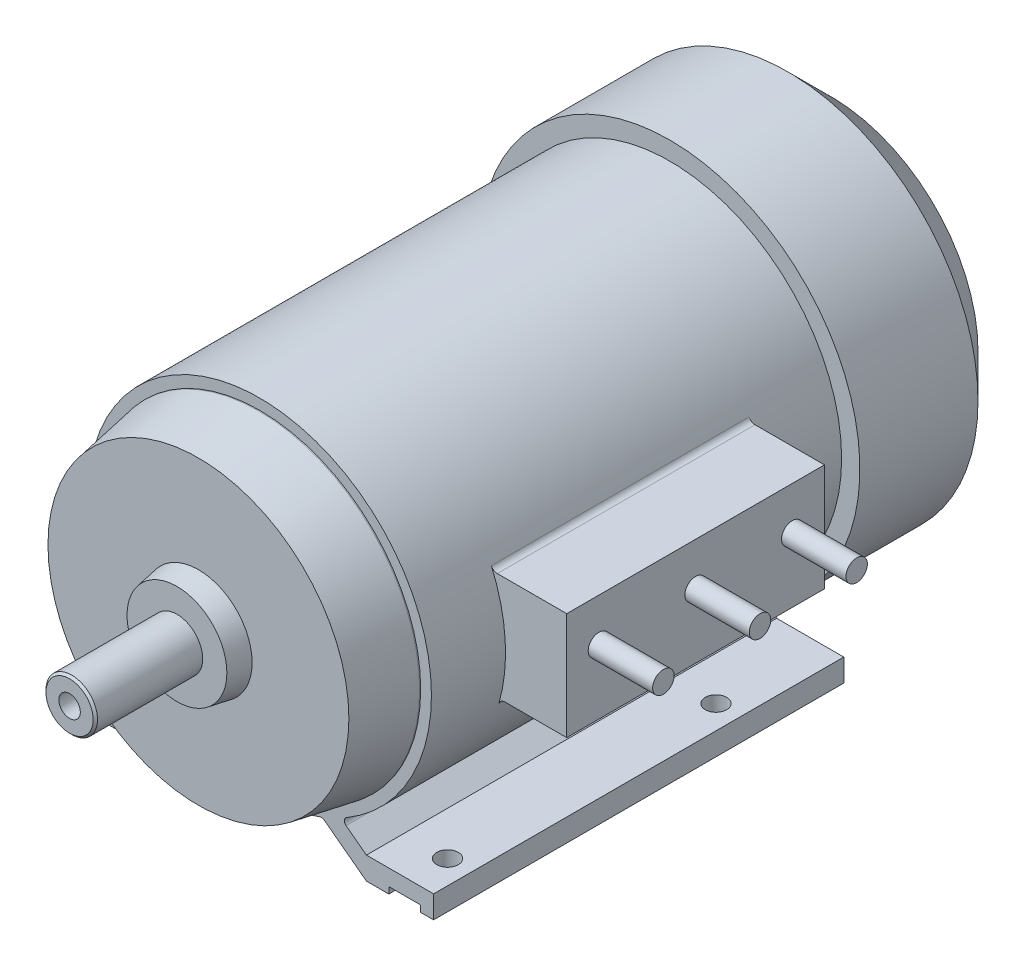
ISO-10303-21;
HEADER;
FILE_DESCRIPTION(('STEP AP214'),'2;1');
FILE_NAME('part.step','',(''),(''),'','','');
FILE_SCHEMA(('AUTOMOTIVE_DESIGN { 1 0 10303 214 1 1 1 1 }'));
ENDSEC;
DATA;
#1=APPLICATION_CONTEXT('core data for automotive mechanical design processes');
#2=APPLICATION_PROTOCOL_DEFINITION('international standard','automotive_design',2000,#1);
#3=PRODUCT_CONTEXT('',#1,'mechanical');
#4=PRODUCT('Part','Part','',(#3));
#5=PRODUCT_RELATED_PRODUCT_CATEGORY('part','',(#4));
#6=PRODUCT_DEFINITION_FORMATION('','',#4);
#7=PRODUCT_DEFINITION_CONTEXT('part definition',#1,'design');
#8=PRODUCT_DEFINITION('design','',#6,#7);
#9=PRODUCT_DEFINITION_SHAPE('','',#8);
#10=(LENGTH_UNIT() NAMED_UNIT(*) SI_UNIT(.MILLI.,.METRE.));
#11=(NAMED_UNIT(*) PLANE_ANGLE_UNIT() SI_UNIT($,.RADIAN.));
#12=(NAMED_UNIT(*) SI_UNIT($,.STERADIAN.) SOLID_ANGLE_UNIT());
#13=UNCERTAINTY_MEASURE_WITH_UNIT(LENGTH_MEASURE(1.E-05),#10,'distance_accuracy_value','');
#14=(GEOMETRIC_REPRESENTATION_CONTEXT(3) GLOBAL_UNCERTAINTY_ASSIGNED_CONTEXT((#13)) GLOBAL_UNIT_ASSIGNED_CONTEXT((#10,
#11,#12)) REPRESENTATION_CONTEXT('',''));
#15=CARTESIAN_POINT('',(0.,0.,0.));
#16=DIRECTION('',(0.,0.,1.));
#17=DIRECTION('',(1.,0.,0.));
#18=AXIS2_PLACEMENT_3D('',#15,#16,#17);
#19=CARTESIAN_POINT('',(0.,88.5,266.));
#20=DIRECTION('',(0.,0.,1.));
#21=DIRECTION('',(1.,0.,0.));
#22=AXIS2_PLACEMENT_3D('',#19,#20,#21);
#23=PLANE('',#22);
#24=CARTESIAN_POINT('',(0.,88.5,266.));
#25=DIRECTION('',(0.,0.,1.));
#26=DIRECTION('',(1.,0.,0.));
#27=AXIS2_PLACEMENT_3D('',#24,#25,#26);
#28=CIRCLE('',#27,75.);
#29=CARTESIAN_POINT('',(-75.,88.5,266.));
#30=VERTEX_POINT('',#29);
#31=EDGE_CURVE('E411',#30,#30,#28,.T.);
#32=ORIENTED_EDGE('',*,*,#31,.F.);
#33=EDGE_LOOP('',(#32));
#34=FACE_BOUND('',#33,.T.);
#35=DIRECTION('',(-1.,0.,0.));
#36=VECTOR('',#35,1.);
#37=CARTESIAN_POINT('',(-60.,1.5,266.));
#38=LINE('',#37,#36);
#39=CARTESIAN_POINT('',(-60.,1.5,266.));
#40=VERTEX_POINT('',#39);
#41=CARTESIAN_POINT('',(-75.,1.5,266.));
#42=VERTEX_POINT('',#41);
#43=EDGE_CURVE('E854',#40,#42,#38,.T.);
#44=ORIENTED_EDGE('',*,*,#43,.F.);
#45=DIRECTION('',(0.,-1.,0.));
#46=VECTOR('',#45,1.);
#47=CARTESIAN_POINT('',(-60.,1.5,266.));
#48=LINE('',#47,#46);
#49=CARTESIAN_POINT('',(-60.,-1.5,266.));
#50=VERTEX_POINT('',#49);
#51=EDGE_CURVE('E852',#40,#50,#48,.T.);
#52=ORIENTED_EDGE('',*,*,#51,.T.);
#53=DIRECTION('',(1.,0.,0.));
#54=VECTOR('',#53,1.);
#55=CARTESIAN_POINT('',(-81.,-1.5,266.));
#56=LINE('',#55,#54);
#57=CARTESIAN_POINT('',(-51.,-1.5,266.));
#58=VERTEX_POINT('',#57);
#59=EDGE_CURVE('E294',#50,#58,#56,.T.);
#60=ORIENTED_EDGE('',*,*,#59,.T.);
#61=DIRECTION('',(0.833616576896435,0.552343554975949,0.));
#62=VECTOR('',#61,1.);
#63=CARTESIAN_POINT('',(-51.,-1.5,266.));
#64=LINE('',#63,#62);
#65=CARTESIAN_POINT('',(-29.018575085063,13.0646076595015,266.));
#66=VERTEX_POINT('',#65);
#67=EDGE_CURVE('E354',#58,#66,#64,.T.);
#68=ORIENTED_EDGE('',*,*,#67,.T.);
#69=CARTESIAN_POINT('',(-27.9138879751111,11.3973745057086,266.));
#70=DIRECTION('',(0.,0.,-1.));
#71=DIRECTION('',(-1.,0.,0.));
#72=AXIS2_PLACEMENT_3D('',#69,#70,#71);
#73=CIRCLE('',#72,2.00000000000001);
#74=CARTESIAN_POINT('',(-27.2330614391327,13.2779263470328,266.));
#75=VERTEX_POINT('',#74);
#76=EDGE_CURVE('E356',#66,#75,#73,.T.);
#77=ORIENTED_EDGE('',*,*,#76,.T.);
#78=CARTESIAN_POINT('',(0.,88.5,266.));
#79=DIRECTION('',(0.,0.,1.));
#80=DIRECTION('',(1.,0.,0.));
#81=AXIS2_PLACEMENT_3D('',#78,#79,#80);
#82=CIRCLE('',#81,80.);
#83=CARTESIAN_POINT('',(28.1164846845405,13.6036496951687,266.));
#84=VERTEX_POINT('',#83);
#85=EDGE_CURVE('E316',#75,#84,#82,.T.);
#86=ORIENTED_EDGE('',*,*,#85,.T.);
#87=CARTESIAN_POINT('',(28.819396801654,11.7312409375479,266.));
#88=DIRECTION('',(0.,0.,-1.));
#89=DIRECTION('',(-1.,0.,0.));
#90=AXIS2_PLACEMENT_3D('',#87,#88,#89);
#91=CIRCLE('',#90,2.00000000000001);
#92=CARTESIAN_POINT('',(30.0218108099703,13.3294275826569,266.));
#93=VERTEX_POINT('',#92);
#94=EDGE_CURVE('E319',#84,#93,#91,.T.);
#95=ORIENTED_EDGE('',*,*,#94,.T.);
#96=DIRECTION('',(-0.799093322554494,0.601207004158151,0.));
#97=VECTOR('',#96,1.);
#98=CARTESIAN_POINT('',(49.7323206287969,-1.5,266.));
#99=LINE('',#98,#97);
#100=CARTESIAN_POINT('',(49.7323206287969,-1.5,266.));
#101=VERTEX_POINT('',#100);
#102=EDGE_CURVE('E321',#101,#93,#99,.T.);
#103=ORIENTED_EDGE('',*,*,#102,.F.);
#104=DIRECTION('',(1.,0.,0.));
#105=VECTOR('',#104,1.);
#106=CARTESIAN_POINT('',(49.7323206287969,-1.5,266.));
#107=LINE('',#106,#105);
#108=CARTESIAN_POINT('',(60.1687024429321,-1.5,266.));
#109=VERTEX_POINT('',#108);
#110=EDGE_CURVE('E325',#101,#109,#107,.T.);
#111=ORIENTED_EDGE('',*,*,#110,.T.);
#112=DIRECTION('',(0.,-1.,0.));
#113=VECTOR('',#112,1.);
#114=CARTESIAN_POINT('',(60.1687024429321,1.5,266.));
#115=LINE('',#114,#113);
#116=CARTESIAN_POINT('',(60.1687024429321,1.5,266.));
#117=VERTEX_POINT('',#116);
#118=EDGE_CURVE('E821',#117,#109,#115,.T.);
#119=ORIENTED_EDGE('',*,*,#118,.F.);
#120=DIRECTION('',(-1.,0.,0.));
#121=VECTOR('',#120,1.);
#122=CARTESIAN_POINT('',(75.,1.5,266.));
#123=LINE('',#122,#121);
#124=CARTESIAN_POINT('',(75.,1.5,266.));
#125=VERTEX_POINT('',#124);
#126=EDGE_CURVE('E826',#125,#117,#123,.T.);
#127=ORIENTED_EDGE('',*,*,#126,.F.);
#128=DIRECTION('',(0.,-1.,0.));
#129=VECTOR('',#128,1.);
#130=CARTESIAN_POINT('',(75.,1.5,266.));
#131=LINE('',#130,#129);
#132=CARTESIAN_POINT('',(75.,-1.5,266.));
#133=VERTEX_POINT('',#132);
#134=EDGE_CURVE('E823',#125,#133,#131,.T.);
#135=ORIENTED_EDGE('',*,*,#134,.T.);
#136=CARTESIAN_POINT('',(81.,-1.5,266.));
#137=VERTEX_POINT('',#136);
#138=EDGE_CURVE('E324',#133,#137,#107,.T.);
#139=ORIENTED_EDGE('',*,*,#138,.T.);
#140=DIRECTION('',(0.,-1.,0.));
#141=VECTOR('',#140,1.);
#142=CARTESIAN_POINT('',(81.,9.,266.));
#143=LINE('',#142,#141);
#144=CARTESIAN_POINT('',(81.,9.,266.));
#145=VERTEX_POINT('',#144);
#146=EDGE_CURVE('E328',#145,#137,#143,.T.);
#147=ORIENTED_EDGE('',*,*,#146,.F.);
#148=DIRECTION('',(-1.,0.,0.));
#149=VECTOR('',#148,1.);
#150=CARTESIAN_POINT('',(81.,9.,266.));
#151=LINE('',#150,#149);
#152=CARTESIAN_POINT('',(49.7323206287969,9.,266.));
#153=VERTEX_POINT('',#152);
#154=EDGE_CURVE('E331',#145,#153,#151,.T.);
#155=ORIENTED_EDGE('',*,*,#154,.T.);
#156=DIRECTION('',(-0.799093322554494,0.601207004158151,0.));
#157=VECTOR('',#156,1.);
#158=CARTESIAN_POINT('',(49.7323206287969,9.,266.));
#159=LINE('',#158,#157);
#160=CARTESIAN_POINT('',(40.2374991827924,16.1435375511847,266.));
#161=VERTEX_POINT('',#160);
#162=EDGE_CURVE('E333',#153,#161,#159,.T.);
#163=ORIENTED_EDGE('',*,*,#162,.T.);
#164=CARTESIAN_POINT('',(41.4399131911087,17.7417241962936,266.));
#165=DIRECTION('',(0.,0.,1.));
#166=DIRECTION('',(1.,0.,0.));
#167=AXIS2_PLACEMENT_3D('',#164,#165,#166);
#168=CIRCLE('',#167,1.99999999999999);
#169=CARTESIAN_POINT('',(40.4291836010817,19.4675358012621,266.));
#170=VERTEX_POINT('',#169);
#171=EDGE_CURVE('E335',#170,#161,#168,.T.);
#172=ORIENTED_EDGE('',*,*,#171,.F.);
#173=CARTESIAN_POINT('',(0.,88.5,266.));
#174=DIRECTION('',(0.,0.,1.));
#175=DIRECTION('',(1.,0.,0.));
#176=AXIS2_PLACEMENT_3D('',#173,#174,#175);
#177=CIRCLE('',#176,80.);
#178=CARTESIAN_POINT('',(-40.4228134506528,19.4638054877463,266.));
#179=VERTEX_POINT('',#178);
#180=EDGE_CURVE('E338',#170,#179,#177,.T.);
#181=ORIENTED_EDGE('',*,*,#180,.T.);
#182=CARTESIAN_POINT('',(-41.4333837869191,17.7379006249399,266.));
#183=DIRECTION('',(0.,0.,1.));
#184=DIRECTION('',(1.,0.,0.));
#185=AXIS2_PLACEMENT_3D('',#182,#183,#184);
#186=CIRCLE('',#185,2.);
#187=CARTESIAN_POINT('',(-40.3286966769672,16.0706674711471,266.));
#188=VERTEX_POINT('',#187);
#189=EDGE_CURVE('E340',#188,#179,#186,.T.);
#190=ORIENTED_EDGE('',*,*,#189,.F.);
#191=DIRECTION('',(0.833616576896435,0.552343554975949,0.));
#192=VECTOR('',#191,1.);
#193=CARTESIAN_POINT('',(-51.,8.99999999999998,266.));
#194=LINE('',#193,#192);
#195=CARTESIAN_POINT('',(-51.,8.99999999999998,266.));
#196=VERTEX_POINT('',#195);
#197=EDGE_CURVE('E343',#196,#188,#194,.T.);
#198=ORIENTED_EDGE('',*,*,#197,.F.);
#199=DIRECTION('',(-1.,0.,0.));
#200=VECTOR('',#199,1.);
#201=CARTESIAN_POINT('',(-51.,8.99999999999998,266.));
#202=LINE('',#201,#200);
#203=CARTESIAN_POINT('',(-81.,8.99999999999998,266.));
#204=VERTEX_POINT('',#203);
#205=EDGE_CURVE('E346',#196,#204,#202,.T.);
#206=ORIENTED_EDGE('',*,*,#205,.T.);
#207=DIRECTION('',(0.,1.,0.));
#208=VECTOR('',#207,1.);
#209=CARTESIAN_POINT('',(-81.,-1.5,266.));
#210=LINE('',#209,#208);
#211=CARTESIAN_POINT('',(-81.,-1.5,266.));
#212=VERTEX_POINT('',#211);
#213=EDGE_CURVE('E348',#212,#204,#210,.T.);
#214=ORIENTED_EDGE('',*,*,#213,.F.);
#215=CARTESIAN_POINT('',(-75.,-1.5,266.));
#216=VERTEX_POINT('',#215);
#217=EDGE_CURVE('E351',#212,#216,#56,.T.);
#218=ORIENTED_EDGE('',*,*,#217,.T.);
#219=DIRECTION('',(0.,-1.,0.));
#220=VECTOR('',#219,1.);
#221=CARTESIAN_POINT('',(-75.,1.5,266.));
#222=LINE('',#221,#220);
#223=EDGE_CURVE('E850',#42,#216,#222,.T.);
#224=ORIENTED_EDGE('',*,*,#223,.F.);
#225=EDGE_LOOP('',(#44,#52,#60,#68,#77,#86,#95,#103,#111,#119,#127,#135,#139,#147,#155,#163,
#172,#181,#190,#198,#206,#214,#218,#224));
#226=FACE_BOUND('',#225,.T.);
#227=ADVANCED_FACE('F32',(#34,#226),#23,.T.);
#228=CARTESIAN_POINT('',(0.,88.5,75.));
#229=DIRECTION('',(0.,0.,1.));
#230=DIRECTION('',(1.,0.,0.));
#231=AXIS2_PLACEMENT_3D('',#228,#229,#230);
#232=PLANE('',#231);
#233=DIRECTION('',(0.,-1.,0.));
#234=VECTOR('',#233,1.);
#235=CARTESIAN_POINT('',(-60.,1.5,75.));
#236=LINE('',#235,#234);
#237=CARTESIAN_POINT('',(-60.,1.5,75.));
#238=VERTEX_POINT('',#237);
#239=CARTESIAN_POINT('',(-60.,-1.5,75.));
#240=VERTEX_POINT('',#239);
#241=EDGE_CURVE('E274',#238,#240,#236,.T.);
#242=ORIENTED_EDGE('',*,*,#241,.F.);
#243=DIRECTION('',(1.,0.,0.));
#244=VECTOR('',#243,1.);
#245=CARTESIAN_POINT('',(-75.,1.5,75.));
#246=LINE('',#245,#244);
#247=CARTESIAN_POINT('',(-75.,1.5,75.));
#248=VERTEX_POINT('',#247);
#249=EDGE_CURVE('E859',#248,#238,#246,.T.);
#250=ORIENTED_EDGE('',*,*,#249,.F.);
#251=DIRECTION('',(0.,-1.,0.));
#252=VECTOR('',#251,1.);
#253=CARTESIAN_POINT('',(-75.,1.5,75.));
#254=LINE('',#253,#252);
#255=CARTESIAN_POINT('',(-75.,-1.5,75.));
#256=VERTEX_POINT('',#255);
#257=EDGE_CURVE('E286',#248,#256,#254,.T.);
#258=ORIENTED_EDGE('',*,*,#257,.T.);
#259=DIRECTION('',(1.,0.,0.));
#260=VECTOR('',#259,1.);
#261=CARTESIAN_POINT('',(-81.,-1.5,75.));
#262=LINE('',#261,#260);
#263=CARTESIAN_POINT('',(-81.,-1.5,75.));
#264=VERTEX_POINT('',#263);
#265=EDGE_CURVE('E302',#264,#256,#262,.T.);
#266=ORIENTED_EDGE('',*,*,#265,.F.);
#267=DIRECTION('',(0.,1.,0.));
#268=VECTOR('',#267,1.);
#269=CARTESIAN_POINT('',(-81.,-1.5,75.));
#270=LINE('',#269,#268);
#271=CARTESIAN_POINT('',(-81.,8.99999999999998,75.));
#272=VERTEX_POINT('',#271);
#273=EDGE_CURVE('E303',#264,#272,#270,.T.);
#274=ORIENTED_EDGE('',*,*,#273,.T.);
#275=DIRECTION('',(-1.,0.,0.));
#276=VECTOR('',#275,1.);
#277=CARTESIAN_POINT('',(-51.,8.99999999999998,75.));
#278=LINE('',#277,#276);
#279=CARTESIAN_POINT('',(-51.,8.99999999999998,75.));
#280=VERTEX_POINT('',#279);
#281=EDGE_CURVE('E307',#280,#272,#278,.T.);
#282=ORIENTED_EDGE('',*,*,#281,.F.);
#283=DIRECTION('',(0.833616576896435,0.552343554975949,0.));
#284=VECTOR('',#283,1.);
#285=CARTESIAN_POINT('',(-51.,8.99999999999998,75.));
#286=LINE('',#285,#284);
#287=CARTESIAN_POINT('',(-45.5412460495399,12.6168997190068,75.));
#288=VERTEX_POINT('',#287);
#289=EDGE_CURVE('E662',#280,#288,#286,.T.);
#290=ORIENTED_EDGE('',*,*,#289,.T.);
#291=CARTESIAN_POINT('',(0.,88.5,75.));
#292=DIRECTION('',(0.,0.,1.));
#293=DIRECTION('',(1.,0.,0.));
#294=AXIS2_PLACEMENT_3D('',#291,#292,#293);
#295=CIRCLE('',#294,88.5);
#296=CARTESIAN_POINT('',(-36.7060158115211,7.9710089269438,75.));
#297=VERTEX_POINT('',#296);
#298=EDGE_CURVE('E397',#288,#297,#295,.T.);
#299=ORIENTED_EDGE('',*,*,#298,.T.);
#300=DIRECTION('',(0.833616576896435,0.552343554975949,0.));
#301=VECTOR('',#300,1.);
#302=CARTESIAN_POINT('',(-51.,-1.5,75.));
#303=LINE('',#302,#301);
#304=CARTESIAN_POINT('',(-51.,-1.5,75.));
#305=VERTEX_POINT('',#304);
#306=EDGE_CURVE('E301',#305,#297,#303,.T.);
#307=ORIENTED_EDGE('',*,*,#306,.F.);
#308=EDGE_CURVE('E292',#240,#305,#262,.T.);
#309=ORIENTED_EDGE('',*,*,#308,.F.);
#310=EDGE_LOOP('',(#242,#250,#258,#266,#274,#282,#290,#299,#307,#309));
#311=FACE_BOUND('',#310,.T.);
#312=ADVANCED_FACE('F298',(#311),#232,.F.);
#313=CARTESIAN_POINT('',(-81.,-1.5,266.));
#314=DIRECTION('',(0.,1.,0.));
#315=DIRECTION('',(0.,0.,1.));
#316=AXIS2_PLACEMENT_3D('',#313,#314,#315);
#317=PLANE('',#316);
#318=DIRECTION('',(0.,0.,-1.));
#319=VECTOR('',#318,1.);
#320=CARTESIAN_POINT('',(-60.,-1.5,266.));
#321=LINE('',#320,#319);
#322=EDGE_CURVE('E277',#50,#240,#321,.T.);
#323=ORIENTED_EDGE('',*,*,#322,.T.);
#324=ORIENTED_EDGE('',*,*,#308,.T.);
#325=DIRECTION('',(0.,0.,-1.));
#326=VECTOR('',#325,1.);
#327=CARTESIAN_POINT('',(-51.,-1.5,266.));
#328=LINE('',#327,#326);
#329=EDGE_CURVE('E363',#58,#305,#328,.T.);
#330=ORIENTED_EDGE('',*,*,#329,.F.);
#331=ORIENTED_EDGE('',*,*,#59,.F.);
#332=EDGE_LOOP('',(#323,#324,#330,#331));
#333=FACE_BOUND('',#332,.T.);
#334=ADVANCED_FACE('F290',(#333),#317,.F.);
#335=DIRECTION('',(0.,0.,1.));
#336=VECTOR('',#335,1.);
#337=CARTESIAN_POINT('',(-75.,-1.5,75.));
#338=LINE('',#337,#336);
#339=EDGE_CURVE('E295',#256,#216,#338,.T.);
#340=ORIENTED_EDGE('',*,*,#339,.T.);
#341=ORIENTED_EDGE('',*,*,#217,.F.);
#342=DIRECTION('',(0.,0.,-1.));
#343=VECTOR('',#342,1.);
#344=CARTESIAN_POINT('',(-81.,-1.5,266.));
#345=LINE('',#344,#343);
#346=EDGE_CURVE('E365',#212,#264,#345,.T.);
#347=ORIENTED_EDGE('',*,*,#346,.T.);
#348=ORIENTED_EDGE('',*,*,#265,.T.);
#349=EDGE_LOOP('',(#340,#341,#347,#348));
#350=FACE_BOUND('',#349,.T.);
#351=ADVANCED_FACE('F532',(#350),#317,.F.);
#352=CARTESIAN_POINT('',(-70.,177.001,248.5));
#353=DIRECTION('',(0.,-1.,0.));
#354=DIRECTION('',(0.,0.,-1.));
#355=AXIS2_PLACEMENT_3D('',#352,#353,#354);
#356=CYLINDRICAL_SURFACE('',#355,5.00000000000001);
#357=CARTESIAN_POINT('',(-70.,8.99999999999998,248.5));
#358=DIRECTION('',(0.,-1.,0.));
#359=DIRECTION('',(1.,0.,0.));
#360=AXIS2_PLACEMENT_3D('',#357,#358,#359);
#361=CIRCLE('',#360,5.00000000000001);
#362=CARTESIAN_POINT('',(-65.,8.99999999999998,248.5));
#363=VERTEX_POINT('',#362);
#364=EDGE_CURVE('E708',#363,#363,#361,.F.);
#365=ORIENTED_EDGE('',*,*,#364,.T.);
#366=EDGE_LOOP('',(#365));
#367=FACE_BOUND('',#366,.T.);
#368=CARTESIAN_POINT('',(-70.,1.5,248.5));
#369=DIRECTION('',(0.,-1.,0.));
#370=DIRECTION('',(0.,0.,-1.));
#371=AXIS2_PLACEMENT_3D('',#368,#369,#370);
#372=CIRCLE('',#371,5.00000000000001);
#373=CARTESIAN_POINT('',(-75.,1.5,248.5));
#374=VERTEX_POINT('',#373);
#375=EDGE_CURVE('E843',#374,#374,#372,.F.);
#376=ORIENTED_EDGE('',*,*,#375,.F.);
#377=EDGE_LOOP('',(#376));
#378=FACE_BOUND('',#377,.T.);
#379=ADVANCED_FACE('F528',(#367,#378),#356,.F.);
#380=CARTESIAN_POINT('',(-70.,177.001,123.5));
#381=DIRECTION('',(0.,-1.,0.));
#382=DIRECTION('',(0.,0.,-1.));
#383=AXIS2_PLACEMENT_3D('',#380,#381,#382);
#384=CYLINDRICAL_SURFACE('',#383,5.00000000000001);
#385=CARTESIAN_POINT('',(-70.,8.99999999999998,123.5));
#386=DIRECTION('',(0.,-1.,0.));
#387=DIRECTION('',(1.,0.,0.));
#388=AXIS2_PLACEMENT_3D('',#385,#386,#387);
#389=CIRCLE('',#388,5.00000000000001);
#390=CARTESIAN_POINT('',(-65.,8.99999999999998,123.5));
#391=VERTEX_POINT('',#390);
#392=EDGE_CURVE('E711',#391,#391,#389,.F.);
#393=ORIENTED_EDGE('',*,*,#392,.T.);
#394=EDGE_LOOP('',(#393));
#395=FACE_BOUND('',#394,.T.);
#396=CARTESIAN_POINT('',(-70.,1.5,123.5));
#397=DIRECTION('',(0.,-1.,0.));
#398=DIRECTION('',(0.,0.,-1.));
#399=AXIS2_PLACEMENT_3D('',#396,#397,#398);
#400=CIRCLE('',#399,5.00000000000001);
#401=CARTESIAN_POINT('',(-75.,1.5,123.5));
#402=VERTEX_POINT('',#401);
#403=EDGE_CURVE('E285',#402,#402,#400,.F.);
#404=ORIENTED_EDGE('',*,*,#403,.F.);
#405=EDGE_LOOP('',(#404));
#406=FACE_BOUND('',#405,.T.);
#407=ADVANCED_FACE('F524',(#395,#406),#384,.F.);
#408=CARTESIAN_POINT('',(-68.,177.001,229.5));
#409=DIRECTION('',(0.,-1.,0.));
#410=DIRECTION('',(0.,0.,-1.));
#411=AXIS2_PLACEMENT_3D('',#408,#409,#410);
#412=CYLINDRICAL_SURFACE('',#411,3.14535828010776);
#413=CARTESIAN_POINT('',(-68.,5.50000000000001,229.5));
#414=DIRECTION('',(0.,-1.,0.));
#415=DIRECTION('',(0.,0.,-1.));
#416=AXIS2_PLACEMENT_3D('',#413,#414,#415);
#417=CIRCLE('',#416,3.14535828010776);
#418=CARTESIAN_POINT('',(-68.,5.50000000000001,226.354641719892));
#419=VERTEX_POINT('',#418);
#420=EDGE_CURVE('E11',#419,#419,#417,.T.);
#421=ORIENTED_EDGE('',*,*,#420,.T.);
#422=EDGE_LOOP('',(#421));
#423=FACE_BOUND('',#422,.T.);
#424=CARTESIAN_POINT('',(-68.,8.99999999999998,229.5));
#425=DIRECTION('',(0.,-1.,0.));
#426=DIRECTION('',(1.,0.,0.));
#427=AXIS2_PLACEMENT_3D('',#424,#425,#426);
#428=CIRCLE('',#427,3.14535828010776);
#429=CARTESIAN_POINT('',(-64.8546417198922,8.99999999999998,229.5));
#430=VERTEX_POINT('',#429);
#431=EDGE_CURVE('E714',#430,#430,#428,.F.);
#432=ORIENTED_EDGE('',*,*,#431,.T.);
#433=EDGE_LOOP('',(#432));
#434=FACE_BOUND('',#433,.T.);
#435=ADVANCED_FACE('F520',(#423,#434),#412,.F.);
#436=CARTESIAN_POINT('',(-68.,177.001,104.562941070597));
#437=DIRECTION('',(0.,-1.,0.));
#438=DIRECTION('',(0.,0.,-1.));
#439=AXIS2_PLACEMENT_3D('',#436,#437,#438);
#440=CYLINDRICAL_SURFACE('',#439,3.14535828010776);
#441=CARTESIAN_POINT('',(-68.,5.50000000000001,104.562941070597));
#442=DIRECTION('',(0.,-1.,0.));
#443=DIRECTION('',(0.,0.,-1.));
#444=AXIS2_PLACEMENT_3D('',#441,#442,#443);
#445=CIRCLE('',#444,3.14535828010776);
#446=CARTESIAN_POINT('',(-68.,5.50000000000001,101.417582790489));
#447=VERTEX_POINT('',#446);
#448=EDGE_CURVE('E40',#447,#447,#445,.T.);
#449=ORIENTED_EDGE('',*,*,#448,.T.);
#450=EDGE_LOOP('',(#449));
#451=FACE_BOUND('',#450,.T.);
#452=CARTESIAN_POINT('',(-68.,8.99999999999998,104.562941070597));
#453=DIRECTION('',(0.,-1.,0.));
#454=DIRECTION('',(1.,0.,0.));
#455=AXIS2_PLACEMENT_3D('',#452,#453,#454);
#456=CIRCLE('',#455,3.14535828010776);
#457=CARTESIAN_POINT('',(-64.8546417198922,8.99999999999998,104.562941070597));
#458=VERTEX_POINT('',#457);
#459=EDGE_CURVE('E717',#458,#458,#456,.F.);
#460=ORIENTED_EDGE('',*,*,#459,.T.);
#461=EDGE_LOOP('',(#460));
#462=FACE_BOUND('',#461,.T.);
#463=ADVANCED_FACE('F516',(#451,#462),#440,.F.);
#464=DIRECTION('',(0.,-1.,0.));
#465=VECTOR('',#464,1.);
#466=CARTESIAN_POINT('',(75.,1.5,75.));
#467=LINE('',#466,#465);
#468=CARTESIAN_POINT('',(75.,1.5,75.));
#469=VERTEX_POINT('',#468);
#470=CARTESIAN_POINT('',(75.,-1.5,75.));
#471=VERTEX_POINT('',#470);
#472=EDGE_CURVE('E815',#469,#471,#467,.T.);
#473=ORIENTED_EDGE('',*,*,#472,.F.);
#474=DIRECTION('',(1.,0.,0.));
#475=VECTOR('',#474,1.);
#476=CARTESIAN_POINT('',(60.1687024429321,1.5,75.));
#477=LINE('',#476,#475);
#478=CARTESIAN_POINT('',(60.1687024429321,1.5,75.));
#479=VERTEX_POINT('',#478);
#480=EDGE_CURVE('E831',#479,#469,#477,.T.);
#481=ORIENTED_EDGE('',*,*,#480,.F.);
#482=DIRECTION('',(0.,-1.,0.));
#483=VECTOR('',#482,1.);
#484=CARTESIAN_POINT('',(60.1687024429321,1.5,75.));
#485=LINE('',#484,#483);
#486=CARTESIAN_POINT('',(60.1687024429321,-1.5,75.));
#487=VERTEX_POINT('',#486);
#488=EDGE_CURVE('E818',#479,#487,#485,.T.);
#489=ORIENTED_EDGE('',*,*,#488,.T.);
#490=DIRECTION('',(1.,0.,0.));
#491=VECTOR('',#490,1.);
#492=CARTESIAN_POINT('',(49.7323206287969,-1.5,75.));
#493=LINE('',#492,#491);
#494=CARTESIAN_POINT('',(49.7323206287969,-1.5,75.));
#495=VERTEX_POINT('',#494);
#496=EDGE_CURVE('E683',#495,#487,#493,.T.);
#497=ORIENTED_EDGE('',*,*,#496,.F.);
#498=DIRECTION('',(-0.799093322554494,0.601207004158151,0.));
#499=VECTOR('',#498,1.);
#500=CARTESIAN_POINT('',(49.7323206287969,-1.5,75.));
#501=LINE('',#500,#499);
#502=CARTESIAN_POINT('',(36.9782648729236,8.09565977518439,75.));
#503=VERTEX_POINT('',#502);
#504=EDGE_CURVE('E687',#495,#503,#501,.T.);
#505=ORIENTED_EDGE('',*,*,#504,.T.);
#506=CARTESIAN_POINT('',(45.1976244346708,12.4117305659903,75.));
#507=VERTEX_POINT('',#506);
#508=EDGE_CURVE('E657',#503,#507,#295,.T.);
#509=ORIENTED_EDGE('',*,*,#508,.T.);
#510=DIRECTION('',(-0.799093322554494,0.601207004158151,0.));
#511=VECTOR('',#510,1.);
#512=CARTESIAN_POINT('',(49.7323206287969,9.,75.));
#513=LINE('',#512,#511);
#514=CARTESIAN_POINT('',(49.7323206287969,9.,75.));
#515=VERTEX_POINT('',#514);
#516=EDGE_CURVE('E675',#515,#507,#513,.T.);
#517=ORIENTED_EDGE('',*,*,#516,.F.);
#518=DIRECTION('',(-1.,0.,0.));
#519=VECTOR('',#518,1.);
#520=CARTESIAN_POINT('',(81.,9.,75.));
#521=LINE('',#520,#519);
#522=CARTESIAN_POINT('',(81.,9.,75.));
#523=VERTEX_POINT('',#522);
#524=EDGE_CURVE('E678',#523,#515,#521,.T.);
#525=ORIENTED_EDGE('',*,*,#524,.F.);
#526=DIRECTION('',(0.,-1.,0.));
#527=VECTOR('',#526,1.);
#528=CARTESIAN_POINT('',(81.,9.,75.));
#529=LINE('',#528,#527);
#530=CARTESIAN_POINT('',(81.,-1.5,75.));
#531=VERTEX_POINT('',#530);
#532=EDGE_CURVE('E680',#523,#531,#529,.T.);
#533=ORIENTED_EDGE('',*,*,#532,.T.);
#534=EDGE_CURVE('E686',#471,#531,#493,.T.);
#535=ORIENTED_EDGE('',*,*,#534,.F.);
#536=EDGE_LOOP('',(#473,#481,#489,#497,#505,#509,#517,#525,#533,#535));
#537=FACE_BOUND('',#536,.T.);
#538=ADVANCED_FACE('F519',(#537),#232,.F.);
#539=CARTESIAN_POINT('',(49.7323206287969,-1.5,266.));
#540=DIRECTION('',(0.,1.,0.));
#541=DIRECTION('',(0.,0.,1.));
#542=AXIS2_PLACEMENT_3D('',#539,#540,#541);
#543=PLANE('',#542);
#544=DIRECTION('',(0.,0.,-1.));
#545=VECTOR('',#544,1.);
#546=CARTESIAN_POINT('',(75.,-1.5,266.));
#547=LINE('',#546,#545);
#548=EDGE_CURVE('E841',#133,#471,#547,.T.);
#549=ORIENTED_EDGE('',*,*,#548,.T.);
#550=ORIENTED_EDGE('',*,*,#534,.T.);
#551=DIRECTION('',(0.,0.,-1.));
#552=VECTOR('',#551,1.);
#553=CARTESIAN_POINT('',(81.,-1.5,266.));
#554=LINE('',#553,#552);
#555=EDGE_CURVE('E386',#137,#531,#554,.T.);
#556=ORIENTED_EDGE('',*,*,#555,.F.);
#557=ORIENTED_EDGE('',*,*,#138,.F.);
#558=EDGE_LOOP('',(#549,#550,#556,#557));
#559=FACE_BOUND('',#558,.T.);
#560=ADVANCED_FACE('F615',(#559),#543,.F.);
#561=DIRECTION('',(0.,0.,1.));
#562=VECTOR('',#561,1.);
#563=CARTESIAN_POINT('',(60.1687024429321,-1.5,75.));
#564=LINE('',#563,#562);
#565=EDGE_CURVE('E838',#487,#109,#564,.T.);
#566=ORIENTED_EDGE('',*,*,#565,.T.);
#567=ORIENTED_EDGE('',*,*,#110,.F.);
#568=DIRECTION('',(0.,0.,-1.));
#569=VECTOR('',#568,1.);
#570=CARTESIAN_POINT('',(49.7323206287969,-1.5,266.));
#571=LINE('',#570,#569);
#572=EDGE_CURVE('E389',#101,#495,#571,.T.);
#573=ORIENTED_EDGE('',*,*,#572,.T.);
#574=ORIENTED_EDGE('',*,*,#496,.T.);
#575=EDGE_LOOP('',(#566,#567,#573,#574));
#576=FACE_BOUND('',#575,.T.);
#577=ADVANCED_FACE('F541',(#576),#543,.F.);
#578=CARTESIAN_POINT('',(70.,177.001,248.5));
#579=DIRECTION('',(0.,-1.,0.));
#580=DIRECTION('',(0.,0.,-1.));
#581=AXIS2_PLACEMENT_3D('',#578,#579,#580);
#582=CYLINDRICAL_SURFACE('',#581,5.00000000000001);
#583=CARTESIAN_POINT('',(70.,9.00000000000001,248.5));
#584=DIRECTION('',(0.,-1.,0.));
#585=DIRECTION('',(1.,0.,0.));
#586=AXIS2_PLACEMENT_3D('',#583,#584,#585);
#587=CIRCLE('',#586,5.00000000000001);
#588=CARTESIAN_POINT('',(75.,9.00000000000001,248.5));
#589=VERTEX_POINT('',#588);
#590=EDGE_CURVE('E696',#589,#589,#587,.F.);
#591=ORIENTED_EDGE('',*,*,#590,.T.);
#592=EDGE_LOOP('',(#591));
#593=FACE_BOUND('',#592,.T.);
#594=CARTESIAN_POINT('',(70.,1.5,248.5));
#595=DIRECTION('',(0.,-1.,0.));
#596=DIRECTION('',(0.,0.,-1.));
#597=AXIS2_PLACEMENT_3D('',#594,#595,#596);
#598=CIRCLE('',#597,5.00000000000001);
#599=CARTESIAN_POINT('',(75.,1.5,248.5));
#600=VERTEX_POINT('',#599);
#601=EDGE_CURVE('E812',#600,#600,#598,.F.);
#602=ORIENTED_EDGE('',*,*,#601,.F.);
#603=EDGE_LOOP('',(#602));
#604=FACE_BOUND('',#603,.T.);
#605=ADVANCED_FACE('F537',(#593,#604),#582,.F.);
#606=CARTESIAN_POINT('',(70.,177.001,123.5));
#607=DIRECTION('',(0.,-1.,0.));
#608=DIRECTION('',(0.,0.,-1.));
#609=AXIS2_PLACEMENT_3D('',#606,#607,#608);
#610=CYLINDRICAL_SURFACE('',#609,5.00000000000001);
#611=CARTESIAN_POINT('',(70.,9.00000000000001,123.5));
#612=DIRECTION('',(0.,-1.,0.));
#613=DIRECTION('',(1.,0.,0.));
#614=AXIS2_PLACEMENT_3D('',#611,#612,#613);
#615=CIRCLE('',#614,5.00000000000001);
#616=CARTESIAN_POINT('',(75.,9.00000000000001,123.5));
#617=VERTEX_POINT('',#616);
#618=EDGE_CURVE('E705',#617,#617,#615,.F.);
#619=ORIENTED_EDGE('',*,*,#618,.T.);
#620=EDGE_LOOP('',(#619));
#621=FACE_BOUND('',#620,.T.);
#622=CARTESIAN_POINT('',(70.,1.5,123.5));
#623=DIRECTION('',(0.,-1.,0.));
#624=DIRECTION('',(0.,0.,-1.));
#625=AXIS2_PLACEMENT_3D('',#622,#623,#624);
#626=CIRCLE('',#625,5.00000000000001);
#627=CARTESIAN_POINT('',(75.,1.5,123.5));
#628=VERTEX_POINT('',#627);
#629=EDGE_CURVE('E951',#628,#628,#626,.F.);
#630=ORIENTED_EDGE('',*,*,#629,.F.);
#631=EDGE_LOOP('',(#630));
#632=FACE_BOUND('',#631,.T.);
#633=ADVANCED_FACE('F534',(#621,#632),#610,.F.);
#634=CARTESIAN_POINT('',(0.,88.5,354.5));
#635=DIRECTION('',(0.,0.,-1.));
#636=DIRECTION('',(-1.,0.,0.));
#637=AXIS2_PLACEMENT_3D('',#634,#635,#636);
#638=CYLINDRICAL_SURFACE('',#637,12.);
#639=CARTESIAN_POINT('',(0.,88.5,304.5));
#640=DIRECTION('',(0.,0.,1.));
#641=DIRECTION('',(1.,0.,0.));
#642=AXIS2_PLACEMENT_3D('',#639,#640,#641);
#643=CIRCLE('',#642,12.);
#644=CARTESIAN_POINT('',(12.,88.5,304.5));
#645=VERTEX_POINT('',#644);
#646=EDGE_CURVE('E419',#645,#645,#643,.T.);
#647=ORIENTED_EDGE('',*,*,#646,.T.);
#648=EDGE_LOOP('',(#647));
#649=FACE_BOUND('',#648,.T.);
#650=CARTESIAN_POINT('',(0.,88.5,353.5));
#651=DIRECTION('',(0.,0.,1.));
#652=DIRECTION('',(1.,0.,0.));
#653=AXIS2_PLACEMENT_3D('',#650,#651,#652);
#654=CIRCLE('',#653,12.);
#655=CARTESIAN_POINT('',(12.,88.5,353.5));
#656=VERTEX_POINT('',#655);
#657=EDGE_CURVE('E418',#656,#656,#654,.F.);
#658=ORIENTED_EDGE('',*,*,#657,.T.);
#659=EDGE_LOOP('',(#658));
#660=FACE_BOUND('',#659,.T.);
#661=DIRECTION('',(0.,0.,-1.));
#662=VECTOR('',#661,1.);
#663=CARTESIAN_POINT('',(-11.3208466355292,84.5202473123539,354.5));
#664=LINE('',#663,#662);
#665=CARTESIAN_POINT('',(-11.3208466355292,84.5202473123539,347.5));
#666=VERTEX_POINT('',#665);
#667=CARTESIAN_POINT('',(-11.3208466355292,84.5202473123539,317.5));
#668=VERTEX_POINT('',#667);
#669=EDGE_CURVE('E954',#666,#668,#664,.T.);
#670=ORIENTED_EDGE('',*,*,#669,.T.);
#671=CARTESIAN_POINT('',(-12.,88.5,321.261798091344));
#672=CARTESIAN_POINT('',(-11.9999990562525,88.2945655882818,321.273373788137));
#673=CARTESIAN_POINT('',(-11.994674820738,88.088168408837,321.268068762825));
#674=CARTESIAN_POINT('',(-11.9736665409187,87.6795116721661,321.223982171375));
#675=CARTESIAN_POINT('',(-11.9579807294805,87.4772528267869,321.1851948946));
#676=CARTESIAN_POINT('',(-11.917676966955,87.082876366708,321.075687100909));
#677=CARTESIAN_POINT('',(-11.8930722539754,86.890744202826,321.00501387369));
#678=CARTESIAN_POINT('',(-11.837201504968,86.5212051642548,320.834055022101));
#679=CARTESIAN_POINT('',(-11.8059343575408,86.3438007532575,320.733764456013));
#680=CARTESIAN_POINT('',(-11.7387030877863,86.0032355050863,320.503215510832));
#681=CARTESIAN_POINT('',(-11.702632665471,85.8406068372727,320.372202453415));
#682=CARTESIAN_POINT('',(-11.630031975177,85.5391831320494,320.085211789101));
#683=CARTESIAN_POINT('',(-11.5935016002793,85.4003937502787,319.929228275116));
#684=CARTESIAN_POINT('',(-11.5225744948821,85.1461540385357,319.590691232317));
#685=CARTESIAN_POINT('',(-11.4882826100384,85.0315866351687,319.407450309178));
#686=CARTESIAN_POINT('',(-11.4271145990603,84.8350711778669,319.023091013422));
#687=CARTESIAN_POINT('',(-11.4002368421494,84.7531159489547,318.821976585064));
#688=CARTESIAN_POINT('',(-11.3578172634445,84.6264526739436,318.413033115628));
#689=CARTESIAN_POINT('',(-11.341995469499,84.5808202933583,318.205520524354));
#690=CARTESIAN_POINT('',(-11.3225882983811,84.5250906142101,317.785243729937));
#691=CARTESIAN_POINT('',(-11.3189984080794,84.514980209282,317.572481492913));
#692=CARTESIAN_POINT('',(-11.3243748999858,84.530294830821,317.158949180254));
#693=CARTESIAN_POINT('',(-11.3327317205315,84.5539946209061,316.958104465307));
#694=CARTESIAN_POINT('',(-11.3599147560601,84.6329524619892,316.563468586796));
#695=CARTESIAN_POINT('',(-11.378741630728,84.6882125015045,316.369677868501));
#696=CARTESIAN_POINT('',(-11.4248442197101,84.8287084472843,315.99341653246));
#697=CARTESIAN_POINT('',(-11.452157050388,84.9140762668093,315.810999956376));
#698=CARTESIAN_POINT('',(-11.5123239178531,85.112214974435,315.462713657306));
#699=CARTESIAN_POINT('',(-11.5451794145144,85.2249930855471,315.29684831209));
#700=CARTESIAN_POINT('',(-11.6149480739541,85.4814757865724,314.97740953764));
#701=CARTESIAN_POINT('',(-11.6519826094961,85.6264612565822,314.824889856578));
#702=CARTESIAN_POINT('',(-11.7248449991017,85.9399459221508,314.545904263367));
#703=CARTESIAN_POINT('',(-11.7606726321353,86.1084493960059,314.419443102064));
#704=CARTESIAN_POINT('',(-11.8283344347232,86.4690218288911,314.19339597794));
#705=CARTESIAN_POINT('',(-11.8600569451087,86.6615460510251,314.094500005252));
#706=CARTESIAN_POINT('',(-11.9152012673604,87.061702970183,313.930838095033));
#707=CARTESIAN_POINT('',(-11.9386252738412,87.2693316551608,313.866063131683));
#708=CARTESIAN_POINT('',(-11.9741549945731,87.6864102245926,313.774658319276));
#709=CARTESIAN_POINT('',(-11.9866143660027,87.8955648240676,313.746820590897));
#710=CARTESIAN_POINT('',(-12.000429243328,88.3159309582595,313.726469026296));
#711=CARTESIAN_POINT('',(-12.0017873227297,88.5271420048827,313.733947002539));
#712=CARTESIAN_POINT('',(-11.9937149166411,88.9375359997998,313.783098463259));
#713=CARTESIAN_POINT('',(-11.9846727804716,89.1368777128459,313.823525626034));
#714=CARTESIAN_POINT('',(-11.9576563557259,89.5259137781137,313.935641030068));
#715=CARTESIAN_POINT('',(-11.9396815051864,89.7156075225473,314.007331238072));
#716=CARTESIAN_POINT('',(-11.8966393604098,90.0825727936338,314.180768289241));
#717=CARTESIAN_POINT('',(-11.8714912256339,90.2596722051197,314.282858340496));
#718=CARTESIAN_POINT('',(-11.8169873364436,90.5946738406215,314.51389727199));
#719=CARTESIAN_POINT('',(-11.7876305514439,90.7525713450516,314.64285273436));
#720=CARTESIAN_POINT('',(-11.7266725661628,91.0513423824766,314.930037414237));
#721=CARTESIAN_POINT('',(-11.6950285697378,91.1912796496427,315.089232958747));
#722=CARTESIAN_POINT('',(-11.6343051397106,91.4427410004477,315.429141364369));
#723=CARTESIAN_POINT('',(-11.6052259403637,91.5542624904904,315.609856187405));
#724=CARTESIAN_POINT('',(-11.5529118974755,91.7465829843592,315.989985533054));
#725=CARTESIAN_POINT('',(-11.5297351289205,91.8270804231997,316.189561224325));
#726=CARTESIAN_POINT('',(-11.4926349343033,91.9530727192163,316.600275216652));
#727=CARTESIAN_POINT('',(-11.4787084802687,91.9985790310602,316.811409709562));
#728=CARTESIAN_POINT('',(-11.462328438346,92.0518696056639,317.230810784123));
#729=CARTESIAN_POINT('',(-11.4594667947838,92.0609959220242,317.438891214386));
#730=CARTESIAN_POINT('',(-11.4644603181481,92.0448865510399,317.853569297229));
#731=CARTESIAN_POINT('',(-11.4723142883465,92.0196547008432,318.060167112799));
#732=CARTESIAN_POINT('',(-11.4974174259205,91.9367400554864,318.461164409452));
#733=CARTESIAN_POINT('',(-11.5144482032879,91.8798105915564,318.655734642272));
#734=CARTESIAN_POINT('',(-11.5557143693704,91.735897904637,319.032599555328));
#735=CARTESIAN_POINT('',(-11.5799509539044,91.6489096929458,319.214892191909));
#736=CARTESIAN_POINT('',(-11.633663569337,91.4443741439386,319.567918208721));
#737=CARTESIAN_POINT('',(-11.6632728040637,91.3260028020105,319.738153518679));
#738=CARTESIAN_POINT('',(-11.7238449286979,91.0631273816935,320.056852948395));
#739=CARTESIAN_POINT('',(-11.7548081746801,90.9186163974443,320.205311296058));
#740=CARTESIAN_POINT('',(-11.8156683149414,90.6016340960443,320.48142400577));
#741=CARTESIAN_POINT('',(-11.8454924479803,90.4283751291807,320.608192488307));
#742=CARTESIAN_POINT('',(-11.8993140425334,90.0622071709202,320.830791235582));
#743=CARTESIAN_POINT('',(-11.9233133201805,89.8693043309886,320.926631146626));
#744=CARTESIAN_POINT('',(-11.9611021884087,89.4833316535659,321.078718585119));
#745=CARTESIAN_POINT('',(-11.975491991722,89.2912312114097,321.137279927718));
#746=CARTESIAN_POINT('',(-11.9949403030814,88.8997245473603,321.223172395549));
#747=CARTESIAN_POINT('',(-12.0000009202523,88.7003199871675,321.250510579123));
#748=CARTESIAN_POINT('',(-12.,88.5,321.261798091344));
#749=B_SPLINE_CURVE_WITH_KNOTS('',3,(#671,#672,#673,#674,#675,#676,#677,#678,#679,#680,#681,
#682,#683,#684,#685,#686,#687,#688,#689,#690,#691,#692,#693,#694,#695,#696,#697,#698,#699,#700,
#701,#702,#703,#704,#705,#706,#707,#708,#709,#710,#711,#712,#713,#714,#715,#716,#717,#718,#719,
#720,#721,#722,#723,#724,#725,#726,#727,#728,#729,#730,#731,#732,#733,#734,#735,#736,#737,#738,
#739,#740,#741,#742,#743,#744,#745,#746,#747,#748),.UNSPECIFIED.,.T.,.F.,(4,2,2,2,2,2,2,2,2,2,2,
2,2,2,2,2,2,2,2,2,2,2,2,2,2,2,2,2,2,2,2,2,2,2,2,2,2,2,4),(0.,0.616547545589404,1.23320026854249,
1.84894143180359,2.46478539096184,3.09772662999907,3.7308178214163,4.38404909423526,
5.0371365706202,5.6730196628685,6.30866811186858,6.91301750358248,7.51740497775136,
8.12447408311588,8.73170333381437,9.36980649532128,10.0080258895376,10.6610211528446,
11.3138435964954,11.9447441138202,12.5754983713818,13.183443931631,13.7914277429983,
14.4065540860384,15.0218313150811,15.6617750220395,16.3017771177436,16.9478521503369,
17.5937155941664,18.2155196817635,18.8372543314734,19.444807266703,20.0524610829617,
20.6779979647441,21.3037003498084,21.9508167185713,22.597731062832,23.1990652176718,
23.8002634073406),.UNSPECIFIED.);
#750=CARTESIAN_POINT('',(-11.4610832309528,92.0557799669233,317.5));
#751=VERTEX_POINT('',#750);
#752=EDGE_CURVE('E426',#668,#751,#749,.T.);
#753=ORIENTED_EDGE('',*,*,#752,.T.);
#754=DIRECTION('',(0.,0.,-1.));
#755=VECTOR('',#754,1.);
#756=CARTESIAN_POINT('',(-11.4610832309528,92.0557799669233,354.5));
#757=LINE('',#756,#755);
#758=CARTESIAN_POINT('',(-11.4610832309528,92.0557799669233,347.5));
#759=VERTEX_POINT('',#758);
#760=EDGE_CURVE('E960',#751,#759,#757,.F.);
#761=ORIENTED_EDGE('',*,*,#760,.T.);
#762=CARTESIAN_POINT('',(-12.,88.5,351.261798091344));
#763=CARTESIAN_POINT('',(-11.9999990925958,88.7064284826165,351.250163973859));
#764=CARTESIAN_POINT('',(-11.9946235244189,88.9119105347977,351.221484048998));
#765=CARTESIAN_POINT('',(-11.9739980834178,89.3149465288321,351.130999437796));
#766=CARTESIAN_POINT('',(-11.9587456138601,89.5124983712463,351.069186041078));
#767=CARTESIAN_POINT('',(-11.9203131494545,89.8938583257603,350.914615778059));
#768=CARTESIAN_POINT('',(-11.8971458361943,90.0776878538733,350.82190841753));
#769=CARTESIAN_POINT('',(-11.8455359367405,90.4273174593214,350.608284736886));
#770=CARTESIAN_POINT('',(-11.8170925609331,90.5931148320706,350.487364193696));
#771=CARTESIAN_POINT('',(-11.7572313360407,90.9070266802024,350.216790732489));
#772=CARTESIAN_POINT('',(-11.725752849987,91.0545228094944,350.066433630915));
#773=CARTESIAN_POINT('',(-11.6641305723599,91.3225910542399,349.743103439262));
#774=CARTESIAN_POINT('',(-11.633986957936,91.4431596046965,349.570127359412));
#775=CARTESIAN_POINT('',(-11.5780877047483,91.6559875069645,349.202560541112));
#776=CARTESIAN_POINT('',(-11.5524216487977,91.7476932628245,349.007634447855));
#777=CARTESIAN_POINT('',(-11.5094799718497,91.8967550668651,348.604199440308));
#778=CARTESIAN_POINT('',(-11.4922019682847,91.9541208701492,348.395694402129));
#779=CARTESIAN_POINT('',(-11.4687692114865,92.0311352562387,347.978215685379));
#780=CARTESIAN_POINT('',(-11.4622726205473,92.0519442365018,347.769475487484));
#781=CARTESIAN_POINT('',(-11.4601946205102,92.0586461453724,347.351401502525));
#782=CARTESIAN_POINT('',(-11.4646112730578,92.0445452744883,347.14206782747));
#783=CARTESIAN_POINT('',(-11.483473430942,91.9829302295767,346.735341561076));
#784=CARTESIAN_POINT('',(-11.4976137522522,91.936432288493,346.537779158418));
#785=CARTESIAN_POINT('',(-11.533873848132,91.8126846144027,346.153316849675));
#786=CARTESIAN_POINT('',(-11.5559947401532,91.7354305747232,345.966418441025));
#787=CARTESIAN_POINT('',(-11.6062157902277,91.5504270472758,345.603938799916));
#788=CARTESIAN_POINT('',(-11.6344379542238,91.4420377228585,345.428701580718));
#789=CARTESIAN_POINT('',(-11.693334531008,91.1984437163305,345.098419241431));
#790=CARTESIAN_POINT('',(-11.7240095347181,91.0632325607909,344.943379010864));
#791=CARTESIAN_POINT('',(-11.7855905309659,90.7636436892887,344.651725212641));
#792=CARTESIAN_POINT('',(-11.8164602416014,90.598346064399,344.516046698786));
#793=CARTESIAN_POINT('',(-11.8735400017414,90.2466361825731,344.274261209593));
#794=CARTESIAN_POINT('',(-11.8997502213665,90.0602246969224,344.168153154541));
#795=CARTESIAN_POINT('',(-11.9441686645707,89.6724542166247,343.989346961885));
#796=CARTESIAN_POINT('',(-11.9624238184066,89.4711913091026,343.91645276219));
#797=CARTESIAN_POINT('',(-11.9887696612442,89.0586227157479,343.80570622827));
#798=CARTESIAN_POINT('',(-11.9968634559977,88.8473201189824,343.767843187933));
#799=CARTESIAN_POINT('',(-12.0015384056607,88.4297694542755,343.729301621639));
#800=CARTESIAN_POINT('',(-11.9985668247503,88.2236569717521,343.72719721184));
#801=CARTESIAN_POINT('',(-11.9821425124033,87.8142725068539,343.756506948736));
#802=CARTESIAN_POINT('',(-11.9686904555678,87.6110003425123,343.787918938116));
#803=CARTESIAN_POINT('',(-11.9326874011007,87.2154906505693,343.882457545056));
#804=CARTESIAN_POINT('',(-11.9102488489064,87.0231491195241,343.945194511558));
#805=CARTESIAN_POINT('',(-11.8582957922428,86.6517515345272,344.100115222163));
#806=CARTESIAN_POINT('',(-11.8287800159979,86.4726978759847,344.192304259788));
#807=CARTESIAN_POINT('',(-11.7642084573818,86.1260598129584,344.407255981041));
#808=CARTESIAN_POINT('',(-11.728993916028,85.9591032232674,344.530982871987));
#809=CARTESIAN_POINT('',(-11.6572231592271,85.6478595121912,344.803979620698));
#810=CARTESIAN_POINT('',(-11.6206665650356,85.5035788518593,344.95325673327));
#811=CARTESIAN_POINT('',(-11.5485578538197,85.2364637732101,345.279606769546));
#812=CARTESIAN_POINT('',(-11.5130897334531,85.1145924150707,345.457489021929));
#813=CARTESIAN_POINT('',(-11.448614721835,84.9025622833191,345.832330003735));
#814=CARTESIAN_POINT('',(-11.4196068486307,84.812398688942,346.02928582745));
#815=CARTESIAN_POINT('',(-11.3720473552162,84.6682596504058,346.432996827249));
#816=CARTESIAN_POINT('',(-11.3533080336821,84.6136309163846,346.639495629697));
#817=CARTESIAN_POINT('',(-11.3278512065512,84.5400313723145,347.059446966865));
#818=CARTESIAN_POINT('',(-11.3211288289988,84.521046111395,347.272896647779));
#819=CARTESIAN_POINT('',(-11.3205956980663,84.519537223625,347.688977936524));
#820=CARTESIAN_POINT('',(-11.3261423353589,84.5351989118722,347.891604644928));
#821=CARTESIAN_POINT('',(-11.3481672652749,84.5986912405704,348.291124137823));
#822=CARTESIAN_POINT('',(-11.364645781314,84.6465225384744,348.488016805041));
#823=CARTESIAN_POINT('',(-11.4065437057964,84.7723871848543,348.869931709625));
#824=CARTESIAN_POINT('',(-11.4319262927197,84.8502962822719,349.054999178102));
#825=CARTESIAN_POINT('',(-11.4889369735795,85.0339446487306,349.409715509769));
#826=CARTESIAN_POINT('',(-11.5205665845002,85.1396906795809,349.579360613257));
#827=CARTESIAN_POINT('',(-11.5885689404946,85.3820466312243,349.907277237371));
#828=CARTESIAN_POINT('',(-11.6250978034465,85.5199105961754,350.064590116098));
#829=CARTESIAN_POINT('',(-11.6978721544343,85.8197826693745,350.354363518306));
#830=CARTESIAN_POINT('',(-11.7341175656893,85.981797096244,350.486817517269));
#831=CARTESIAN_POINT('',(-11.8037844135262,86.3312854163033,350.727005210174));
#832=CARTESIAN_POINT('',(-11.8370879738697,86.5193789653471,350.833874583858));
#833=CARTESIAN_POINT('',(-11.8961206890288,86.9120349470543,351.01416595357));
#834=CARTESIAN_POINT('',(-11.9218532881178,87.116589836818,351.087603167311));
#835=CARTESIAN_POINT('',(-11.9611791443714,87.5167378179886,351.193232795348));
#836=CARTESIAN_POINT('',(-11.9756769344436,87.7114025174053,351.228618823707));
#837=CARTESIAN_POINT('',(-11.9950869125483,88.1043337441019,351.268461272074));
#838=CARTESIAN_POINT('',(-12.0000008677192,88.3025996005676,351.272923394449));
#839=CARTESIAN_POINT('',(-12.,88.5,351.261798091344));
#840=B_SPLINE_CURVE_WITH_KNOTS('',3,(#762,#763,#764,#765,#766,#767,#768,#769,#770,#771,#772,
#773,#774,#775,#776,#777,#778,#779,#780,#781,#782,#783,#784,#785,#786,#787,#788,#789,#790,#791,
#792,#793,#794,#795,#796,#797,#798,#799,#800,#801,#802,#803,#804,#805,#806,#807,#808,#809,#810,
#811,#812,#813,#814,#815,#816,#817,#818,#819,#820,#821,#822,#823,#824,#825,#826,#827,#828,#829,
#830,#831,#832,#833,#834,#835,#836,#837,#838,#839),.UNSPECIFIED.,.T.,.F.,(4,2,2,2,2,2,2,2,2,2,2,
2,2,2,2,2,2,2,2,2,2,2,2,2,2,2,2,2,2,2,2,2,2,2,2,2,2,2,4),(0.,0.619537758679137,1.23923846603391,
1.85795087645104,2.47675595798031,3.11273222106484,3.74879263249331,4.39639882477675,
5.04382096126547,5.67029366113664,6.2966550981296,6.90420479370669,7.51183959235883,
8.13298435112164,8.75427920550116,9.39940830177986,10.0445138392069,10.6857603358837,
11.3268107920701,11.9422364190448,12.5576224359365,13.1655375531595,13.7735619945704,
14.4030454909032,15.0327080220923,15.6851176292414,16.3374280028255,16.9773790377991,
17.6170705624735,18.2240540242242,18.8310498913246,19.4355646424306,20.040226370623,
20.6743871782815,21.3087141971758,21.962139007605,22.6152660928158,23.2078178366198,
23.8002603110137),.UNSPECIFIED.);
#841=EDGE_CURVE('E433',#666,#759,#840,.T.);
#842=ORIENTED_EDGE('',*,*,#841,.F.);
#843=EDGE_LOOP('',(#670,#753,#761,#842));
#844=FACE_BOUND('',#843,.T.);
#845=ADVANCED_FACE('F438',(#649,#660,#844),#638,.T.);
#846=CARTESIAN_POINT('',(108.5,68.5,111.5));
#847=DIRECTION('',(1.,0.,0.));
#848=DIRECTION('',(0.,1.,0.));
#849=AXIS2_PLACEMENT_3D('',#846,#847,#848);
#850=PLANE('',#849);
#851=CARTESIAN_POINT('',(108.5,98.5,171.5));
#852=DIRECTION('',(1.,0.,0.));
#853=DIRECTION('',(0.,1.,0.));
#854=AXIS2_PLACEMENT_3D('',#851,#852,#853);
#855=CIRCLE('',#854,4.99999999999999);
#856=CARTESIAN_POINT('',(108.5,103.5,171.5));
#857=VERTEX_POINT('',#856);
#858=EDGE_CURVE('E774',#857,#857,#855,.T.);
#859=ORIENTED_EDGE('',*,*,#858,.F.);
#860=EDGE_LOOP('',(#859));
#861=FACE_BOUND('',#860,.T.);
#862=CARTESIAN_POINT('',(108.5,98.5,216.5));
#863=DIRECTION('',(1.,0.,0.));
#864=DIRECTION('',(0.,1.,0.));
#865=AXIS2_PLACEMENT_3D('',#862,#863,#864);
#866=CIRCLE('',#865,5.00000000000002);
#867=CARTESIAN_POINT('',(108.5,103.5,216.5));
#868=VERTEX_POINT('',#867);
#869=EDGE_CURVE('E422',#868,#868,#866,.T.);
#870=ORIENTED_EDGE('',*,*,#869,.F.);
#871=EDGE_LOOP('',(#870));
#872=FACE_BOUND('',#871,.T.);
#873=DIRECTION('',(0.,1.,0.));
#874=VECTOR('',#873,1.);
#875=CARTESIAN_POINT('',(108.5,68.5,231.5));
#876=LINE('',#875,#874);
#877=CARTESIAN_POINT('',(108.5,68.5,231.5));
#878=VERTEX_POINT('',#877);
#879=CARTESIAN_POINT('',(108.5,118.5,231.5));
#880=VERTEX_POINT('',#879);
#881=EDGE_CURVE('E763',#878,#880,#876,.T.);
#882=ORIENTED_EDGE('',*,*,#881,.F.);
#883=DIRECTION('',(0.,0.,1.));
#884=VECTOR('',#883,1.);
#885=CARTESIAN_POINT('',(108.5,68.5,111.5));
#886=LINE('',#885,#884);
#887=CARTESIAN_POINT('',(108.5,68.5,111.5));
#888=VERTEX_POINT('',#887);
#889=EDGE_CURVE('E725',#888,#878,#886,.T.);
#890=ORIENTED_EDGE('',*,*,#889,.F.);
#891=DIRECTION('',(0.,1.,0.));
#892=VECTOR('',#891,1.);
#893=CARTESIAN_POINT('',(108.5,68.5,111.5));
#894=LINE('',#893,#892);
#895=CARTESIAN_POINT('',(108.5,118.5,111.5));
#896=VERTEX_POINT('',#895);
#897=EDGE_CURVE('E749',#888,#896,#894,.T.);
#898=ORIENTED_EDGE('',*,*,#897,.T.);
#899=DIRECTION('',(0.,0.,1.));
#900=VECTOR('',#899,1.);
#901=CARTESIAN_POINT('',(108.5,118.5,111.5));
#902=LINE('',#901,#900);
#903=EDGE_CURVE('E726',#896,#880,#902,.T.);
#904=ORIENTED_EDGE('',*,*,#903,.T.);
#905=EDGE_LOOP('',(#882,#890,#898,#904));
#906=FACE_BOUND('',#905,.T.);
#907=CARTESIAN_POINT('',(108.5,98.5,126.5));
#908=DIRECTION('',(1.,0.,0.));
#909=DIRECTION('',(0.,1.,0.));
#910=AXIS2_PLACEMENT_3D('',#907,#908,#909);
#911=CIRCLE('',#910,4.99999999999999);
#912=CARTESIAN_POINT('',(108.5,103.5,126.5));
#913=VERTEX_POINT('',#912);
#914=EDGE_CURVE('E780',#913,#913,#911,.T.);
#915=ORIENTED_EDGE('',*,*,#914,.F.);
#916=EDGE_LOOP('',(#915));
#917=FACE_BOUND('',#916,.T.);
#918=ADVANCED_FACE('F511',(#861,#872,#906,#917),#850,.T.);
#919=CARTESIAN_POINT('',(0.,88.5,75.));
#920=DIRECTION('',(0.,0.,1.));
#921=DIRECTION('',(1.,0.,0.));
#922=AXIS2_PLACEMENT_3D('',#919,#920,#921);
#923=PLANE('',#922);
#924=EDGE_CURVE('E396',#507,#288,#295,.T.);
#925=ORIENTED_EDGE('',*,*,#924,.T.);
#926=CARTESIAN_POINT('',(-40.3286966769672,16.0706674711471,75.));
#927=VERTEX_POINT('',#926);
#928=EDGE_CURVE('E652',#288,#927,#286,.T.);
#929=ORIENTED_EDGE('',*,*,#928,.T.);
#930=CARTESIAN_POINT('',(-41.4333837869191,17.7379006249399,75.));
#931=DIRECTION('',(0.,0.,1.));
#932=DIRECTION('',(1.,0.,0.));
#933=AXIS2_PLACEMENT_3D('',#930,#931,#932);
#934=CIRCLE('',#933,2.);
#935=CARTESIAN_POINT('',(-40.4228134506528,19.4638054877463,75.));
#936=VERTEX_POINT('',#935);
#937=EDGE_CURVE('E667',#927,#936,#934,.T.);
#938=ORIENTED_EDGE('',*,*,#937,.T.);
#939=CARTESIAN_POINT('',(0.,88.5,75.));
#940=DIRECTION('',(0.,0.,1.));
#941=DIRECTION('',(1.,0.,0.));
#942=AXIS2_PLACEMENT_3D('',#939,#940,#941);
#943=CIRCLE('',#942,80.);
#944=CARTESIAN_POINT('',(40.4291836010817,19.4675358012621,75.));
#945=VERTEX_POINT('',#944);
#946=EDGE_CURVE('E668',#945,#936,#943,.T.);
#947=ORIENTED_EDGE('',*,*,#946,.F.);
#948=CARTESIAN_POINT('',(41.4399131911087,17.7417241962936,75.));
#949=DIRECTION('',(0.,0.,1.));
#950=DIRECTION('',(1.,0.,0.));
#951=AXIS2_PLACEMENT_3D('',#948,#949,#950);
#952=CIRCLE('',#951,1.99999999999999);
#953=CARTESIAN_POINT('',(40.2374991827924,16.1435375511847,75.));
#954=VERTEX_POINT('',#953);
#955=EDGE_CURVE('E673',#945,#954,#952,.T.);
#956=ORIENTED_EDGE('',*,*,#955,.T.);
#957=EDGE_CURVE('E654',#507,#954,#513,.T.);
#958=ORIENTED_EDGE('',*,*,#957,.F.);
#959=EDGE_LOOP('',(#925,#929,#938,#947,#956,#958));
#960=FACE_BOUND('',#959,.T.);
#961=ADVANCED_FACE('F514',(#960),#923,.T.);
#962=CARTESIAN_POINT('',(0.,88.5,75.));
#963=DIRECTION('',(0.,0.,-1.));
#964=DIRECTION('',(-1.,0.,0.));
#965=AXIS2_PLACEMENT_3D('',#962,#963,#964);
#966=CYLINDRICAL_SURFACE('',#965,88.5);
#967=CARTESIAN_POINT('',(0.,88.5,20.0000000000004));
#968=DIRECTION('',(0.,0.,1.));
#969=DIRECTION('',(1.,0.,0.));
#970=AXIS2_PLACEMENT_3D('',#967,#968,#969);
#971=CIRCLE('',#970,88.5);
#972=CARTESIAN_POINT('',(88.5,88.5,20.0000000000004));
#973=VERTEX_POINT('',#972);
#974=EDGE_CURVE('E399',#973,#973,#971,.T.);
#975=ORIENTED_EDGE('',*,*,#974,.T.);
#976=EDGE_LOOP('',(#975));
#977=FACE_BOUND('',#976,.T.);
#978=ORIENTED_EDGE('',*,*,#298,.F.);
#979=ORIENTED_EDGE('',*,*,#924,.F.);
#980=ORIENTED_EDGE('',*,*,#508,.F.);
#981=EDGE_CURVE('E400',#297,#503,#295,.T.);
#982=ORIENTED_EDGE('',*,*,#981,.F.);
#983=EDGE_LOOP('',(#978,#979,#980,#982));
#984=FACE_BOUND('',#983,.T.);
#985=ADVANCED_FACE('F34',(#977,#984),#966,.T.);
#986=CARTESIAN_POINT('',(-29.018575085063,13.0646076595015,75.));
#987=VERTEX_POINT('',#986);
#988=EDGE_CURVE('E313',#297,#987,#303,.T.);
#989=ORIENTED_EDGE('',*,*,#988,.F.);
#990=ORIENTED_EDGE('',*,*,#981,.T.);
#991=CARTESIAN_POINT('',(30.0218108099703,13.3294275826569,75.));
#992=VERTEX_POINT('',#991);
#993=EDGE_CURVE('E406',#503,#992,#501,.T.);
#994=ORIENTED_EDGE('',*,*,#993,.T.);
#995=CARTESIAN_POINT('',(28.819396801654,11.7312409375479,75.));
#996=DIRECTION('',(0.,0.,-1.));
#997=DIRECTION('',(-1.,0.,0.));
#998=AXIS2_PLACEMENT_3D('',#995,#996,#997);
#999=CIRCLE('',#998,2.00000000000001);
#1000=CARTESIAN_POINT('',(28.1164846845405,13.6036496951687,75.));
#1001=VERTEX_POINT('',#1000);
#1002=EDGE_CURVE('E690',#1001,#992,#999,.T.);
#1003=ORIENTED_EDGE('',*,*,#1002,.F.);
#1004=CARTESIAN_POINT('',(0.,88.5,75.));
#1005=DIRECTION('',(0.,0.,1.));
#1006=DIRECTION('',(1.,0.,0.));
#1007=AXIS2_PLACEMENT_3D('',#1004,#1005,#1006);
#1008=CIRCLE('',#1007,80.);
#1009=CARTESIAN_POINT('',(-27.2330614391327,13.2779263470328,75.));
#1010=VERTEX_POINT('',#1009);
#1011=EDGE_CURVE('E693',#1010,#1001,#1008,.T.);
#1012=ORIENTED_EDGE('',*,*,#1011,.F.);
#1013=CARTESIAN_POINT('',(-27.9138879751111,11.3973745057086,75.));
#1014=DIRECTION('',(0.,0.,-1.));
#1015=DIRECTION('',(-1.,0.,0.));
#1016=AXIS2_PLACEMENT_3D('',#1013,#1014,#1015);
#1017=CIRCLE('',#1016,2.00000000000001);
#1018=EDGE_CURVE('E312',#987,#1010,#1017,.T.);
#1019=ORIENTED_EDGE('',*,*,#1018,.F.);
#1020=EDGE_LOOP('',(#989,#990,#994,#1003,#1012,#1019));
#1021=FACE_BOUND('',#1020,.T.);
#1022=ADVANCED_FACE('F636',(#1021),#923,.T.);
#1023=CARTESIAN_POINT('',(0.,88.5,0.));
#1024=DIRECTION('',(0.,0.,1.));
#1025=DIRECTION('',(1.,0.,0.));
#1026=AXIS2_PLACEMENT_3D('',#1023,#1024,#1025);
#1027=PLANE('',#1026);
#1028=CARTESIAN_POINT('',(0.,88.5,0.));
#1029=DIRECTION('',(0.,0.,1.));
#1030=DIRECTION('',(1.,0.,0.));
#1031=AXIS2_PLACEMENT_3D('',#1028,#1029,#1030);
#1032=CIRCLE('',#1031,68.4999999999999);
#1033=CARTESIAN_POINT('',(68.4999999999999,88.5,0.));
#1034=VERTEX_POINT('',#1033);
#1035=EDGE_CURVE('E403',#1034,#1034,#1032,.F.);
#1036=ORIENTED_EDGE('',*,*,#1035,.T.);
#1037=EDGE_LOOP('',(#1036));
#1038=FACE_BOUND('',#1037,.T.);
#1039=ADVANCED_FACE('F633',(#1038),#1027,.F.);
#1040=CARTESIAN_POINT('',(0.,88.5,20.0000000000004));
#1041=DIRECTION('',(0.,0.,1.));
#1042=DIRECTION('',(1.,0.,0.));
#1043=AXIS2_PLACEMENT_3D('',#1040,#1041,#1042);
#1044=CONICAL_SURFACE('',#1043,88.5,0.785398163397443);
#1045=ORIENTED_EDGE('',*,*,#1035,.F.);
#1046=EDGE_LOOP('',(#1045));
#1047=FACE_BOUND('',#1046,.T.);
#1048=ORIENTED_EDGE('',*,*,#974,.F.);
#1049=EDGE_LOOP('',(#1048));
#1050=FACE_BOUND('',#1049,.T.);
#1051=ADVANCED_FACE('F629',(#1047,#1050),#1044,.T.);
#1052=CARTESIAN_POINT('',(0.,88.5,266.));
#1053=DIRECTION('',(0.,0.,-1.));
#1054=DIRECTION('',(-1.,0.,0.));
#1055=AXIS2_PLACEMENT_3D('',#1052,#1053,#1054);
#1056=CYLINDRICAL_SURFACE('',#1055,80.);
#1057=DIRECTION('',(0.,0.,-1.));
#1058=VECTOR('',#1057,1.);
#1059=CARTESIAN_POINT('',(-27.2330614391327,13.2779263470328,266.));
#1060=LINE('',#1059,#1058);
#1061=EDGE_CURVE('E358',#75,#1010,#1060,.T.);
#1062=ORIENTED_EDGE('',*,*,#1061,.T.);
#1063=ORIENTED_EDGE('',*,*,#1011,.T.);
#1064=DIRECTION('',(0.,0.,-1.));
#1065=VECTOR('',#1064,1.);
#1066=CARTESIAN_POINT('',(28.1164846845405,13.6036496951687,266.));
#1067=LINE('',#1066,#1065);
#1068=EDGE_CURVE('E394',#84,#1001,#1067,.T.);
#1069=ORIENTED_EDGE('',*,*,#1068,.F.);
#1070=ORIENTED_EDGE('',*,*,#85,.F.);
#1071=EDGE_LOOP('',(#1062,#1063,#1069,#1070));
#1072=FACE_BOUND('',#1071,.T.);
#1073=ADVANCED_FACE('F625',(#1072),#1056,.T.);
#1074=CARTESIAN_POINT('',(28.819396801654,11.7312409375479,266.));
#1075=DIRECTION('',(0.,0.,-1.));
#1076=DIRECTION('',(-1.,0.,0.));
#1077=AXIS2_PLACEMENT_3D('',#1074,#1075,#1076);
#1078=CYLINDRICAL_SURFACE('',#1077,2.00000000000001);
#1079=ORIENTED_EDGE('',*,*,#1002,.T.);
#1080=DIRECTION('',(0.,0.,-1.));
#1081=VECTOR('',#1080,1.);
#1082=CARTESIAN_POINT('',(30.0218108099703,13.3294275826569,266.));
#1083=LINE('',#1082,#1081);
#1084=EDGE_CURVE('E391',#93,#992,#1083,.T.);
#1085=ORIENTED_EDGE('',*,*,#1084,.F.);
#1086=ORIENTED_EDGE('',*,*,#94,.F.);
#1087=ORIENTED_EDGE('',*,*,#1068,.T.);
#1088=EDGE_LOOP('',(#1079,#1085,#1086,#1087));
#1089=FACE_BOUND('',#1088,.T.);
#1090=ADVANCED_FACE('F621',(#1089),#1078,.F.);
#1091=CARTESIAN_POINT('',(49.7323206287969,-1.5,266.));
#1092=DIRECTION('',(-0.601207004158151,-0.799093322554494,0.));
#1093=DIRECTION('',(0.799093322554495,-0.601207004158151,0.));
#1094=AXIS2_PLACEMENT_3D('',#1091,#1092,#1093);
#1095=PLANE('',#1094);
#1096=ORIENTED_EDGE('',*,*,#504,.F.);
#1097=ORIENTED_EDGE('',*,*,#572,.F.);
#1098=ORIENTED_EDGE('',*,*,#102,.T.);
#1099=ORIENTED_EDGE('',*,*,#1084,.T.);
#1100=ORIENTED_EDGE('',*,*,#993,.F.);
#1101=EDGE_LOOP('',(#1096,#1097,#1098,#1099,#1100));
#1102=FACE_BOUND('',#1101,.T.);
#1103=ADVANCED_FACE('F613',(#1102),#1095,.T.);
#1104=CARTESIAN_POINT('',(81.,9.,266.));
#1105=DIRECTION('',(1.,0.,0.));
#1106=DIRECTION('',(0.,0.,-1.));
#1107=AXIS2_PLACEMENT_3D('',#1104,#1105,#1106);
#1108=PLANE('',#1107);
#1109=ORIENTED_EDGE('',*,*,#532,.F.);
#1110=DIRECTION('',(0.,0.,-1.));
#1111=VECTOR('',#1110,1.);
#1112=CARTESIAN_POINT('',(81.,9.,266.));
#1113=LINE('',#1112,#1111);
#1114=EDGE_CURVE('E384',#145,#523,#1113,.T.);
#1115=ORIENTED_EDGE('',*,*,#1114,.F.);
#1116=ORIENTED_EDGE('',*,*,#146,.T.);
#1117=ORIENTED_EDGE('',*,*,#555,.T.);
#1118=EDGE_LOOP('',(#1109,#1115,#1116,#1117));
#1119=FACE_BOUND('',#1118,.T.);
#1120=ADVANCED_FACE('F609',(#1119),#1108,.T.);
#1121=CARTESIAN_POINT('',(81.,9.,266.));
#1122=DIRECTION('',(0.,-1.,0.));
#1123=DIRECTION('',(1.,0.,0.));
#1124=AXIS2_PLACEMENT_3D('',#1121,#1122,#1123);
#1125=PLANE('',#1124);
#1126=ORIENTED_EDGE('',*,*,#618,.F.);
#1127=EDGE_LOOP('',(#1126));
#1128=FACE_BOUND('',#1127,.T.);
#1129=ORIENTED_EDGE('',*,*,#590,.F.);
#1130=EDGE_LOOP('',(#1129));
#1131=FACE_BOUND('',#1130,.T.);
#1132=ORIENTED_EDGE('',*,*,#524,.T.);
#1133=DIRECTION('',(0.,0.,-1.));
#1134=VECTOR('',#1133,1.);
#1135=CARTESIAN_POINT('',(49.7323206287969,9.,266.));
#1136=LINE('',#1135,#1134);
#1137=EDGE_CURVE('E381',#153,#515,#1136,.T.);
#1138=ORIENTED_EDGE('',*,*,#1137,.F.);
#1139=ORIENTED_EDGE('',*,*,#154,.F.);
#1140=ORIENTED_EDGE('',*,*,#1114,.T.);
#1141=EDGE_LOOP('',(#1132,#1138,#1139,#1140));
#1142=FACE_BOUND('',#1141,.T.);
#1143=ADVANCED_FACE('F605',(#1128,#1131,#1142),#1125,.F.);
#1144=CARTESIAN_POINT('',(49.7323206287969,9.,266.));
#1145=DIRECTION('',(-0.601207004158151,-0.799093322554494,0.));
#1146=DIRECTION('',(0.799093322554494,-0.601207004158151,0.));
#1147=AXIS2_PLACEMENT_3D('',#1144,#1145,#1146);
#1148=PLANE('',#1147);
#1149=ORIENTED_EDGE('',*,*,#516,.T.);
#1150=ORIENTED_EDGE('',*,*,#957,.T.);
#1151=DIRECTION('',(0.,0.,-1.));
#1152=VECTOR('',#1151,1.);
#1153=CARTESIAN_POINT('',(40.2374991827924,16.1435375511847,266.));
#1154=LINE('',#1153,#1152);
#1155=EDGE_CURVE('E378',#161,#954,#1154,.T.);
#1156=ORIENTED_EDGE('',*,*,#1155,.F.);
#1157=ORIENTED_EDGE('',*,*,#162,.F.);
#1158=ORIENTED_EDGE('',*,*,#1137,.T.);
#1159=EDGE_LOOP('',(#1149,#1150,#1156,#1157,#1158));
#1160=FACE_BOUND('',#1159,.T.);
#1161=ADVANCED_FACE('F601',(#1160),#1148,.F.);
#1162=CARTESIAN_POINT('',(41.4399131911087,17.7417241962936,266.));
#1163=DIRECTION('',(0.,0.,-1.));
#1164=DIRECTION('',(-1.,0.,0.));
#1165=AXIS2_PLACEMENT_3D('',#1162,#1163,#1164);
#1166=CYLINDRICAL_SURFACE('',#1165,1.99999999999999);
#1167=ORIENTED_EDGE('',*,*,#955,.F.);
#1168=DIRECTION('',(0.,0.,-1.));
#1169=VECTOR('',#1168,1.);
#1170=CARTESIAN_POINT('',(40.4291836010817,19.4675358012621,266.));
#1171=LINE('',#1170,#1169);
#1172=EDGE_CURVE('E376',#170,#945,#1171,.T.);
#1173=ORIENTED_EDGE('',*,*,#1172,.F.);
#1174=ORIENTED_EDGE('',*,*,#171,.T.);
#1175=ORIENTED_EDGE('',*,*,#1155,.T.);
#1176=EDGE_LOOP('',(#1167,#1173,#1174,#1175));
#1177=FACE_BOUND('',#1176,.T.);
#1178=ADVANCED_FACE('F597',(#1177),#1166,.F.);
#1179=CARTESIAN_POINT('',(0.,88.5,266.));
#1180=DIRECTION('',(0.,0.,-1.));
#1181=DIRECTION('',(-1.,0.,0.));
#1182=AXIS2_PLACEMENT_3D('',#1179,#1180,#1181);
#1183=CYLINDRICAL_SURFACE('',#1182,80.);
#1184=ORIENTED_EDGE('',*,*,#946,.T.);
#1185=DIRECTION('',(0.,0.,-1.));
#1186=VECTOR('',#1185,1.);
#1187=CARTESIAN_POINT('',(-40.4228134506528,19.4638054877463,266.));
#1188=LINE('',#1187,#1186);
#1189=EDGE_CURVE('E374',#179,#936,#1188,.T.);
#1190=ORIENTED_EDGE('',*,*,#1189,.F.);
#1191=ORIENTED_EDGE('',*,*,#180,.F.);
#1192=ORIENTED_EDGE('',*,*,#1172,.T.);
#1193=EDGE_LOOP('',(#1184,#1190,#1191,#1192));
#1194=FACE_BOUND('',#1193,.T.);
#1195=CARTESIAN_POINT('',(0.,88.5,231.5));
#1196=DIRECTION('',(0.,0.,1.));
#1197=DIRECTION('',(1.,0.,0.));
#1198=AXIS2_PLACEMENT_3D('',#1195,#1196,#1197);
#1199=CIRCLE('',#1198,80.);
#1200=CARTESIAN_POINT('',(76.8670921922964,66.3313253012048,231.5));
#1201=VERTEX_POINT('',#1200);
#1202=CARTESIAN_POINT('',(73.4050419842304,120.307228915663,231.5));
#1203=VERTEX_POINT('',#1202);
#1204=EDGE_CURVE('E722',#1201,#1203,#1199,.T.);
#1205=ORIENTED_EDGE('',*,*,#1204,.T.);
#1206=DIRECTION('',(0.,0.,1.));
#1207=VECTOR('',#1206,1.);
#1208=CARTESIAN_POINT('',(73.4050419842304,120.307228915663,111.5));
#1209=LINE('',#1208,#1207);
#1210=CARTESIAN_POINT('',(73.4050419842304,120.307228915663,111.5));
#1211=VERTEX_POINT('',#1210);
#1212=EDGE_CURVE('E732',#1211,#1203,#1209,.T.);
#1213=ORIENTED_EDGE('',*,*,#1212,.F.);
#1214=CARTESIAN_POINT('',(0.,88.5,111.5));
#1215=DIRECTION('',(0.,0.,1.));
#1216=DIRECTION('',(1.,0.,0.));
#1217=AXIS2_PLACEMENT_3D('',#1214,#1215,#1216);
#1218=CIRCLE('',#1217,80.);
#1219=CARTESIAN_POINT('',(76.8670921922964,66.3313253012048,111.5));
#1220=VERTEX_POINT('',#1219);
#1221=EDGE_CURVE('E720',#1220,#1211,#1218,.T.);
#1222=ORIENTED_EDGE('',*,*,#1221,.F.);
#1223=DIRECTION('',(0.,0.,1.));
#1224=VECTOR('',#1223,1.);
#1225=CARTESIAN_POINT('',(76.8670921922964,66.3313253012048,111.5));
#1226=LINE('',#1225,#1224);
#1227=EDGE_CURVE('E735',#1220,#1201,#1226,.T.);
#1228=ORIENTED_EDGE('',*,*,#1227,.T.);
#1229=EDGE_LOOP('',(#1205,#1213,#1222,#1228));
#1230=FACE_BOUND('',#1229,.T.);
#1231=ADVANCED_FACE('F593',(#1194,#1230),#1183,.T.);
#1232=CARTESIAN_POINT('',(-41.4333837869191,17.7379006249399,266.));
#1233=DIRECTION('',(0.,0.,-1.));
#1234=DIRECTION('',(-1.,0.,0.));
#1235=AXIS2_PLACEMENT_3D('',#1232,#1233,#1234);
#1236=CYLINDRICAL_SURFACE('',#1235,2.);
#1237=ORIENTED_EDGE('',*,*,#937,.F.);
#1238=DIRECTION('',(0.,0.,-1.));
#1239=VECTOR('',#1238,1.);
#1240=CARTESIAN_POINT('',(-40.3286966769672,16.0706674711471,266.));
#1241=LINE('',#1240,#1239);
#1242=EDGE_CURVE('E371',#188,#927,#1241,.T.);
#1243=ORIENTED_EDGE('',*,*,#1242,.F.);
#1244=ORIENTED_EDGE('',*,*,#189,.T.);
#1245=ORIENTED_EDGE('',*,*,#1189,.T.);
#1246=EDGE_LOOP('',(#1237,#1243,#1244,#1245));
#1247=FACE_BOUND('',#1246,.T.);
#1248=ADVANCED_FACE('F589',(#1247),#1236,.F.);
#1249=CARTESIAN_POINT('',(-51.,8.99999999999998,266.));
#1250=DIRECTION('',(-0.552343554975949,0.833616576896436,0.));
#1251=DIRECTION('',(-0.833616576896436,-0.552343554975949,0.));
#1252=AXIS2_PLACEMENT_3D('',#1249,#1250,#1251);
#1253=PLANE('',#1252);
#1254=ORIENTED_EDGE('',*,*,#289,.F.);
#1255=DIRECTION('',(0.,0.,-1.));
#1256=VECTOR('',#1255,1.);
#1257=CARTESIAN_POINT('',(-51.,8.99999999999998,266.));
#1258=LINE('',#1257,#1256);
#1259=EDGE_CURVE('E369',#196,#280,#1258,.T.);
#1260=ORIENTED_EDGE('',*,*,#1259,.F.);
#1261=ORIENTED_EDGE('',*,*,#197,.T.);
#1262=ORIENTED_EDGE('',*,*,#1242,.T.);
#1263=ORIENTED_EDGE('',*,*,#928,.F.);
#1264=EDGE_LOOP('',(#1254,#1260,#1261,#1262,#1263));
#1265=FACE_BOUND('',#1264,.T.);
#1266=ADVANCED_FACE('F585',(#1265),#1253,.T.);
#1267=CARTESIAN_POINT('',(-51.,8.99999999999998,266.));
#1268=DIRECTION('',(0.,-1.,0.));
#1269=DIRECTION('',(1.,0.,0.));
#1270=AXIS2_PLACEMENT_3D('',#1267,#1268,#1269);
#1271=PLANE('',#1270);
#1272=ORIENTED_EDGE('',*,*,#459,.F.);
#1273=EDGE_LOOP('',(#1272));
#1274=FACE_BOUND('',#1273,.T.);
#1275=ORIENTED_EDGE('',*,*,#431,.F.);
#1276=EDGE_LOOP('',(#1275));
#1277=FACE_BOUND('',#1276,.T.);
#1278=ORIENTED_EDGE('',*,*,#392,.F.);
#1279=EDGE_LOOP('',(#1278));
#1280=FACE_BOUND('',#1279,.T.);
#1281=ORIENTED_EDGE('',*,*,#364,.F.);
#1282=EDGE_LOOP('',(#1281));
#1283=FACE_BOUND('',#1282,.T.);
#1284=ORIENTED_EDGE('',*,*,#281,.T.);
#1285=DIRECTION('',(0.,0.,-1.));
#1286=VECTOR('',#1285,1.);
#1287=CARTESIAN_POINT('',(-81.,8.99999999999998,266.));
#1288=LINE('',#1287,#1286);
#1289=EDGE_CURVE('E367',#204,#272,#1288,.T.);
#1290=ORIENTED_EDGE('',*,*,#1289,.F.);
#1291=ORIENTED_EDGE('',*,*,#205,.F.);
#1292=ORIENTED_EDGE('',*,*,#1259,.T.);
#1293=EDGE_LOOP('',(#1284,#1290,#1291,#1292));
#1294=FACE_BOUND('',#1293,.T.);
#1295=ADVANCED_FACE('F581',(#1274,#1277,#1280,#1283,#1294),#1271,.F.);
#1296=CARTESIAN_POINT('',(-81.,-1.5,266.));
#1297=DIRECTION('',(-1.,0.,0.));
#1298=DIRECTION('',(0.,0.,1.));
#1299=AXIS2_PLACEMENT_3D('',#1296,#1297,#1298);
#1300=PLANE('',#1299);
#1301=ORIENTED_EDGE('',*,*,#273,.F.);
#1302=ORIENTED_EDGE('',*,*,#346,.F.);
#1303=ORIENTED_EDGE('',*,*,#213,.T.);
#1304=ORIENTED_EDGE('',*,*,#1289,.T.);
#1305=EDGE_LOOP('',(#1301,#1302,#1303,#1304));
#1306=FACE_BOUND('',#1305,.T.);
#1307=ADVANCED_FACE('F575',(#1306),#1300,.T.);
#1308=CARTESIAN_POINT('',(-51.,-1.5,266.));
#1309=DIRECTION('',(-0.552343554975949,0.833616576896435,0.));
#1310=DIRECTION('',(-0.833616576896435,-0.552343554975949,0.));
#1311=AXIS2_PLACEMENT_3D('',#1308,#1309,#1310);
#1312=PLANE('',#1311);
#1313=ORIENTED_EDGE('',*,*,#306,.T.);
#1314=ORIENTED_EDGE('',*,*,#988,.T.);
#1315=DIRECTION('',(0.,0.,-1.));
#1316=VECTOR('',#1315,1.);
#1317=CARTESIAN_POINT('',(-29.018575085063,13.0646076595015,266.));
#1318=LINE('',#1317,#1316);
#1319=EDGE_CURVE('E360',#66,#987,#1318,.T.);
#1320=ORIENTED_EDGE('',*,*,#1319,.F.);
#1321=ORIENTED_EDGE('',*,*,#67,.F.);
#1322=ORIENTED_EDGE('',*,*,#329,.T.);
#1323=EDGE_LOOP('',(#1313,#1314,#1320,#1321,#1322));
#1324=FACE_BOUND('',#1323,.T.);
#1325=ADVANCED_FACE('F571',(#1324),#1312,.F.);
#1326=CARTESIAN_POINT('',(-27.9138879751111,11.3973745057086,266.));
#1327=DIRECTION('',(0.,0.,-1.));
#1328=DIRECTION('',(-1.,0.,0.));
#1329=AXIS2_PLACEMENT_3D('',#1326,#1327,#1328);
#1330=CYLINDRICAL_SURFACE('',#1329,2.00000000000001);
#1331=ORIENTED_EDGE('',*,*,#1018,.T.);
#1332=ORIENTED_EDGE('',*,*,#1061,.F.);
#1333=ORIENTED_EDGE('',*,*,#76,.F.);
#1334=ORIENTED_EDGE('',*,*,#1319,.T.);
#1335=EDGE_LOOP('',(#1331,#1332,#1333,#1334));
#1336=FACE_BOUND('',#1335,.T.);
#1337=ADVANCED_FACE('F567',(#1336),#1330,.F.);
#1338=CARTESIAN_POINT('',(0.,88.5,294.5));
#1339=DIRECTION('',(0.,0.,-1.));
#1340=DIRECTION('',(-1.,0.,0.));
#1341=AXIS2_PLACEMENT_3D('',#1338,#1339,#1340);
#1342=CYLINDRICAL_SURFACE('',#1341,75.);
#1343=CARTESIAN_POINT('',(0.,88.5,266.5));
#1344=DIRECTION('',(0.,0.,1.));
#1345=DIRECTION('',(1.,0.,0.));
#1346=AXIS2_PLACEMENT_3D('',#1343,#1344,#1345);
#1347=CIRCLE('',#1346,75.);
#1348=CARTESIAN_POINT('',(-75.,88.5,266.5));
#1349=VERTEX_POINT('',#1348);
#1350=EDGE_CURVE('E410',#1349,#1349,#1347,.F.);
#1351=CARTESIAN_POINT('',(-75.,88.5,266.5));
#1352=CARTESIAN_POINT('',(-75.,88.5,266.494791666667));
#1353=CARTESIAN_POINT('',(-75.,88.5,266.489583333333));
#1354=CARTESIAN_POINT('',(-75.,88.5,266.479166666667));
#1355=CARTESIAN_POINT('',(-75.,88.5,266.473958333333));
#1356=CARTESIAN_POINT('',(-75.,88.5,266.463541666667));
#1357=CARTESIAN_POINT('',(-75.,88.5,266.458333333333));
#1358=CARTESIAN_POINT('',(-75.,88.5,266.447916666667));
#1359=CARTESIAN_POINT('',(-75.,88.5,266.442708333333));
#1360=CARTESIAN_POINT('',(-75.,88.5,266.432291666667));
#1361=CARTESIAN_POINT('',(-75.,88.5,266.427083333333));
#1362=CARTESIAN_POINT('',(-75.,88.5,266.416666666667));
#1363=CARTESIAN_POINT('',(-75.,88.5,266.411458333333));
#1364=CARTESIAN_POINT('',(-75.,88.5,266.401041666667));
#1365=CARTESIAN_POINT('',(-75.,88.5,266.395833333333));
#1366=CARTESIAN_POINT('',(-75.,88.5,266.385416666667));
#1367=CARTESIAN_POINT('',(-75.,88.5,266.380208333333));
#1368=CARTESIAN_POINT('',(-75.,88.5,266.369791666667));
#1369=CARTESIAN_POINT('',(-75.,88.5,266.364583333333));
#1370=CARTESIAN_POINT('',(-75.,88.5,266.354166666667));
#1371=CARTESIAN_POINT('',(-75.,88.5,266.348958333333));
#1372=CARTESIAN_POINT('',(-75.,88.5,266.338541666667));
#1373=CARTESIAN_POINT('',(-75.,88.5,266.333333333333));
#1374=CARTESIAN_POINT('',(-75.,88.5,266.322916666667));
#1375=CARTESIAN_POINT('',(-75.,88.5,266.317708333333));
#1376=CARTESIAN_POINT('',(-75.,88.5,266.307291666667));
#1377=CARTESIAN_POINT('',(-75.,88.5,266.302083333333));
#1378=CARTESIAN_POINT('',(-75.,88.5,266.291666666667));
#1379=CARTESIAN_POINT('',(-75.,88.5,266.286458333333));
#1380=CARTESIAN_POINT('',(-75.,88.5,266.276041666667));
#1381=CARTESIAN_POINT('',(-75.,88.5,266.270833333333));
#1382=CARTESIAN_POINT('',(-75.,88.5,266.260416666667));
#1383=CARTESIAN_POINT('',(-75.,88.5,266.255208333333));
#1384=CARTESIAN_POINT('',(-75.,88.5,266.244791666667));
#1385=CARTESIAN_POINT('',(-75.,88.5,266.239583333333));
#1386=CARTESIAN_POINT('',(-75.,88.5,266.229166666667));
#1387=CARTESIAN_POINT('',(-75.,88.5,266.223958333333));
#1388=CARTESIAN_POINT('',(-75.,88.5,266.213541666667));
#1389=CARTESIAN_POINT('',(-75.,88.5,266.208333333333));
#1390=CARTESIAN_POINT('',(-75.,88.5,266.197916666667));
#1391=CARTESIAN_POINT('',(-75.,88.5,266.192708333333));
#1392=CARTESIAN_POINT('',(-75.,88.5,266.182291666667));
#1393=CARTESIAN_POINT('',(-75.,88.5,266.177083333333));
#1394=CARTESIAN_POINT('',(-75.,88.5,266.166666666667));
#1395=CARTESIAN_POINT('',(-75.,88.5,266.161458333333));
#1396=CARTESIAN_POINT('',(-75.,88.5,266.151041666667));
#1397=CARTESIAN_POINT('',(-75.,88.5,266.145833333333));
#1398=CARTESIAN_POINT('',(-75.,88.5,266.135416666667));
#1399=CARTESIAN_POINT('',(-75.,88.5,266.130208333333));
#1400=CARTESIAN_POINT('',(-75.,88.5,266.119791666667));
#1401=CARTESIAN_POINT('',(-75.,88.5,266.114583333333));
#1402=CARTESIAN_POINT('',(-75.,88.5,266.104166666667));
#1403=CARTESIAN_POINT('',(-75.,88.5,266.098958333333));
#1404=CARTESIAN_POINT('',(-75.,88.5,266.088541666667));
#1405=CARTESIAN_POINT('',(-75.,88.5,266.083333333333));
#1406=CARTESIAN_POINT('',(-75.,88.5,266.072916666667));
#1407=CARTESIAN_POINT('',(-75.,88.5,266.067708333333));
#1408=CARTESIAN_POINT('',(-75.,88.5,266.057291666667));
#1409=CARTESIAN_POINT('',(-75.,88.5,266.052083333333));
#1410=CARTESIAN_POINT('',(-75.,88.5,266.041666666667));
#1411=CARTESIAN_POINT('',(-75.,88.5,266.036458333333));
#1412=CARTESIAN_POINT('',(-75.,88.5,266.026041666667));
#1413=CARTESIAN_POINT('',(-75.,88.5,266.020833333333));
#1414=CARTESIAN_POINT('',(-75.,88.5,266.010416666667));
#1415=CARTESIAN_POINT('',(-75.,88.5,266.005208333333));
#1416=CARTESIAN_POINT('',(-75.,88.5,266.));
#1417=B_SPLINE_CURVE_WITH_KNOTS('',3,(#1351,#1352,#1353,#1354,#1355,#1356,#1357,#1358,#1359,
#1360,#1361,#1362,#1363,#1364,#1365,#1366,#1367,#1368,#1369,#1370,#1371,#1372,#1373,#1374,#1375,
#1376,#1377,#1378,#1379,#1380,#1381,#1382,#1383,#1384,#1385,#1386,#1387,#1388,#1389,#1390,#1391,
#1392,#1393,#1394,#1395,#1396,#1397,#1398,#1399,#1400,#1401,#1402,#1403,#1404,#1405,#1406,#1407,
#1408,#1409,#1410,#1411,#1412,#1413,#1414,#1415,#1416),.UNSPECIFIED.,.F.,.F.,(4,2,2,2,2,2,2,2,2,
2,2,2,2,2,2,2,2,2,2,2,2,2,2,2,2,2,2,2,2,2,2,2,4),(0.,0.0156250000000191,0.0312500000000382,
0.0468750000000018,0.0625000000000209,0.07812500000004,0.0937500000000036,0.109375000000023,
0.125000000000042,0.140625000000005,0.156250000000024,0.171875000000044,0.187500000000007,
0.203125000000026,0.218750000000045,0.234375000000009,0.250000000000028,0.265625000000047,
0.281250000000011,0.29687500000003,0.312500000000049,0.328125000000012,0.343750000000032,
0.359375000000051,0.375000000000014,0.390625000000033,0.406250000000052,0.421875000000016,
0.437500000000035,0.453125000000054,0.468750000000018,0.484375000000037,0.500000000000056),.UNSPECIFIED.);
#1418=EDGE_CURVE('BSEAM570',#1349,#30,#1417,.T.);
#1419=ORIENTED_EDGE('',*,*,#1350,.T.);
#1420=ORIENTED_EDGE('',*,*,#31,.T.);
#1421=ORIENTED_EDGE('',*,*,#1418,.T.);
#1422=ORIENTED_EDGE('',*,*,#1418,.F.);
#1423=EDGE_LOOP('',(#1419,#1421,#1420,#1422));
#1424=FACE_BOUND('',#1423,.T.);
#1425=ADVANCED_FACE('F570',(#1424),#1342,.T.);
#1426=CARTESIAN_POINT('',(0.,88.5,294.5));
#1427=DIRECTION('',(0.,0.,1.));
#1428=DIRECTION('',(1.,0.,0.));
#1429=AXIS2_PLACEMENT_3D('',#1426,#1427,#1428);
#1430=PLANE('',#1429);
#1431=CARTESIAN_POINT('',(0.,88.5,294.5));
#1432=DIRECTION('',(0.,0.,1.));
#1433=DIRECTION('',(1.,0.,0.));
#1434=AXIS2_PLACEMENT_3D('',#1431,#1432,#1433);
#1435=CIRCLE('',#1434,25.);
#1436=CARTESIAN_POINT('',(25.,88.5,294.5));
#1437=VERTEX_POINT('',#1436);
#1438=EDGE_CURVE('E414',#1437,#1437,#1435,.T.);
#1439=ORIENTED_EDGE('',*,*,#1438,.F.);
#1440=EDGE_LOOP('',(#1439));
#1441=FACE_BOUND('',#1440,.T.);
#1442=CARTESIAN_POINT('',(0.,88.5,294.5));
#1443=DIRECTION('',(0.,0.,1.));
#1444=DIRECTION('',(1.,0.,0.));
#1445=AXIS2_PLACEMENT_3D('',#1442,#1443,#1444);
#1446=CIRCLE('',#1445,70.0628445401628);
#1447=CARTESIAN_POINT('',(-70.0628445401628,88.5,294.5));
#1448=VERTEX_POINT('',#1447);
#1449=EDGE_CURVE('E407',#1448,#1448,#1446,.T.);
#1450=ORIENTED_EDGE('',*,*,#1449,.T.);
#1451=EDGE_LOOP('',(#1450));
#1452=FACE_BOUND('',#1451,.T.);
#1453=ADVANCED_FACE('F1163',(#1441,#1452),#1430,.T.);
#1454=CARTESIAN_POINT('',(0.,88.5,294.5));
#1455=DIRECTION('',(0.,0.,-1.));
#1456=DIRECTION('',(-1.,0.,0.));
#1457=AXIS2_PLACEMENT_3D('',#1454,#1455,#1456);
#1458=CONICAL_SURFACE('',#1457,70.0628445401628,0.17453292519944);
#1459=CARTESIAN_POINT('',(-75.,88.5,266.5));
#1460=CARTESIAN_POINT('',(-74.9485712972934,88.5,266.791666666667));
#1461=CARTESIAN_POINT('',(-74.8971425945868,88.5,267.083333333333));
#1462=CARTESIAN_POINT('',(-74.7942851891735,88.5,267.666666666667));
#1463=CARTESIAN_POINT('',(-74.7428564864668,88.5,267.958333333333));
#1464=CARTESIAN_POINT('',(-74.6399990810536,88.5,268.541666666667));
#1465=CARTESIAN_POINT('',(-74.5885703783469,88.5,268.833333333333));
#1466=CARTESIAN_POINT('',(-74.4857129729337,88.5,269.416666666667));
#1467=CARTESIAN_POINT('',(-74.434284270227,88.5,269.708333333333));
#1468=CARTESIAN_POINT('',(-74.3314268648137,88.5,270.291666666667));
#1469=CARTESIAN_POINT('',(-74.2799981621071,88.5,270.583333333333));
#1470=CARTESIAN_POINT('',(-74.1771407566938,88.5,271.166666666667));
#1471=CARTESIAN_POINT('',(-74.1257120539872,88.5,271.458333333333));
#1472=CARTESIAN_POINT('',(-74.0228546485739,88.5,272.041666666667));
#1473=CARTESIAN_POINT('',(-73.9714259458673,88.5,272.333333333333));
#1474=CARTESIAN_POINT('',(-73.868568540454,88.5,272.916666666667));
#1475=CARTESIAN_POINT('',(-73.8171398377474,88.5,273.208333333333));
#1476=CARTESIAN_POINT('',(-73.7142824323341,88.5,273.791666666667));
#1477=CARTESIAN_POINT('',(-73.6628537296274,88.5,274.083333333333));
#1478=CARTESIAN_POINT('',(-73.5599963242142,88.5,274.666666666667));
#1479=CARTESIAN_POINT('',(-73.5085676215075,88.5,274.958333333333));
#1480=CARTESIAN_POINT('',(-73.4057102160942,88.5,275.541666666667));
#1481=CARTESIAN_POINT('',(-73.3542815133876,88.5,275.833333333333));
#1482=CARTESIAN_POINT('',(-73.2514241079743,88.5,276.416666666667));
#1483=CARTESIAN_POINT('',(-73.1999954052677,88.5,276.708333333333));
#1484=CARTESIAN_POINT('',(-73.0971379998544,88.5,277.291666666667));
#1485=CARTESIAN_POINT('',(-73.0457092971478,88.5,277.583333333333));
#1486=CARTESIAN_POINT('',(-72.9428518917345,88.5,278.166666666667));
#1487=CARTESIAN_POINT('',(-72.8914231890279,88.5,278.458333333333));
#1488=CARTESIAN_POINT('',(-72.7885657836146,88.5,279.041666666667));
#1489=CARTESIAN_POINT('',(-72.737137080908,88.5,279.333333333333));
#1490=CARTESIAN_POINT('',(-72.6342796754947,88.5,279.916666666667));
#1491=CARTESIAN_POINT('',(-72.5828509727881,88.5,280.208333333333));
#1492=CARTESIAN_POINT('',(-72.4799935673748,88.5,280.791666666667));
#1493=CARTESIAN_POINT('',(-72.4285648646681,88.5,281.083333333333));
#1494=CARTESIAN_POINT('',(-72.3257074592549,88.5,281.666666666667));
#1495=CARTESIAN_POINT('',(-72.2742787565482,88.5,281.958333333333));
#1496=CARTESIAN_POINT('',(-72.171421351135,88.5,282.541666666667));
#1497=CARTESIAN_POINT('',(-72.1199926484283,88.5,282.833333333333));
#1498=CARTESIAN_POINT('',(-72.017135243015,88.5,283.416666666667));
#1499=CARTESIAN_POINT('',(-71.9657065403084,88.5,283.708333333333));
#1500=CARTESIAN_POINT('',(-71.8628491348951,88.5,284.291666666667));
#1501=CARTESIAN_POINT('',(-71.8114204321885,88.5,284.583333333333));
#1502=CARTESIAN_POINT('',(-71.7085630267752,88.5,285.166666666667));
#1503=CARTESIAN_POINT('',(-71.6571343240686,88.5,285.458333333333));
#1504=CARTESIAN_POINT('',(-71.5542769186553,88.5,286.041666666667));
#1505=CARTESIAN_POINT('',(-71.5028482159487,88.5,286.333333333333));
#1506=CARTESIAN_POINT('',(-71.3999908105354,88.5,286.916666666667));
#1507=CARTESIAN_POINT('',(-71.3485621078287,88.5,287.208333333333));
#1508=CARTESIAN_POINT('',(-71.2457047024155,88.5,287.791666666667));
#1509=CARTESIAN_POINT('',(-71.1942759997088,88.5,288.083333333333));
#1510=CARTESIAN_POINT('',(-71.0914185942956,88.5,288.666666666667));
#1511=CARTESIAN_POINT('',(-71.0399898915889,88.5,288.958333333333));
#1512=CARTESIAN_POINT('',(-70.9371324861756,88.5,289.541666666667));
#1513=CARTESIAN_POINT('',(-70.885703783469,88.5,289.833333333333));
#1514=CARTESIAN_POINT('',(-70.7828463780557,88.5,290.416666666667));
#1515=CARTESIAN_POINT('',(-70.7314176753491,88.5,290.708333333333));
#1516=CARTESIAN_POINT('',(-70.6285602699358,88.5,291.291666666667));
#1517=CARTESIAN_POINT('',(-70.5771315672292,88.5,291.583333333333));
#1518=CARTESIAN_POINT('',(-70.4742741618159,88.5,292.166666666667));
#1519=CARTESIAN_POINT('',(-70.4228454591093,88.5,292.458333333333));
#1520=CARTESIAN_POINT('',(-70.319988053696,88.5,293.041666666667));
#1521=CARTESIAN_POINT('',(-70.2685593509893,88.5,293.333333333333));
#1522=CARTESIAN_POINT('',(-70.1657019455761,88.5,293.916666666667));
#1523=CARTESIAN_POINT('',(-70.1142732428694,88.5,294.208333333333));
#1524=CARTESIAN_POINT('',(-70.0628445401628,88.5,294.5));
#1525=B_SPLINE_CURVE_WITH_KNOTS('',3,(#1459,#1460,#1461,#1462,#1463,#1464,#1465,#1466,#1467,
#1468,#1469,#1470,#1471,#1472,#1473,#1474,#1475,#1476,#1477,#1478,#1479,#1480,#1481,#1482,#1483,
#1484,#1485,#1486,#1487,#1488,#1489,#1490,#1491,#1492,#1493,#1494,#1495,#1496,#1497,#1498,#1499,
#1500,#1501,#1502,#1503,#1504,#1505,#1506,#1507,#1508,#1509,#1510,#1511,#1512,#1513,#1514,#1515,
#1516,#1517,#1518,#1519,#1520,#1521,#1522,#1523,#1524),.UNSPECIFIED.,.F.,.F.,(4,2,2,2,2,2,2,2,2,
2,2,2,2,2,2,2,2,2,2,2,2,2,2,2,2,2,2,2,2,2,2,2,4),(0.,0.888498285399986,1.77699657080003,
2.66549485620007,3.55399314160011,4.4424914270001,5.33098971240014,6.21948799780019,
7.10798628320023,7.99648456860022,8.88498285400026,9.7734811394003,10.6619794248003,
11.5504777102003,12.4389759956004,13.3274742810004,14.2159725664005,15.1044708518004,
15.9929691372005,16.8814674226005,17.7699657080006,18.6584639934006,19.5469622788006,
20.4354605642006,21.3239588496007,22.2124571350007,23.1009554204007,23.9894537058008,
24.8779519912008,25.7664502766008,26.6549485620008,27.5434468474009,28.4319451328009),.UNSPECIFIED.);
#1526=EDGE_CURVE('BSEAM552',#1349,#1448,#1525,.T.);
#1527=ORIENTED_EDGE('',*,*,#1350,.F.);
#1528=ORIENTED_EDGE('',*,*,#1449,.F.);
#1529=ORIENTED_EDGE('',*,*,#1526,.T.);
#1530=ORIENTED_EDGE('',*,*,#1526,.F.);
#1531=EDGE_LOOP('',(#1527,#1529,#1528,#1530));
#1532=FACE_BOUND('',#1531,.T.);
#1533=ADVANCED_FACE('F552',(#1532),#1458,.T.);
#1534=CARTESIAN_POINT('',(0.,88.5,304.5));
#1535=DIRECTION('',(0.,0.,1.));
#1536=DIRECTION('',(1.,0.,0.));
#1537=AXIS2_PLACEMENT_3D('',#1534,#1535,#1536);
#1538=PLANE('',#1537);
#1539=CARTESIAN_POINT('',(0.,88.5,304.5));
#1540=DIRECTION('',(0.,0.,1.));
#1541=DIRECTION('',(1.,0.,0.));
#1542=AXIS2_PLACEMENT_3D('',#1539,#1540,#1541);
#1543=CIRCLE('',#1542,23.2367301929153);
#1544=CARTESIAN_POINT('',(23.2367301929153,88.5,304.5));
#1545=VERTEX_POINT('',#1544);
#1546=EDGE_CURVE('E423',#1545,#1545,#1543,.T.);
#1547=ORIENTED_EDGE('',*,*,#1546,.T.);
#1548=EDGE_LOOP('',(#1547));
#1549=FACE_BOUND('',#1548,.T.);
#1550=ORIENTED_EDGE('',*,*,#646,.F.);
#1551=EDGE_LOOP('',(#1550));
#1552=FACE_BOUND('',#1551,.T.);
#1553=ADVANCED_FACE('F547',(#1549,#1552),#1538,.T.);
#1554=CARTESIAN_POINT('',(0.,88.5,354.5));
#1555=DIRECTION('',(0.,0.,1.));
#1556=DIRECTION('',(1.,0.,0.));
#1557=AXIS2_PLACEMENT_3D('',#1554,#1555,#1556);
#1558=PLANE('',#1557);
#1559=CARTESIAN_POINT('',(0.,88.5,354.5));
#1560=DIRECTION('',(0.,0.,1.));
#1561=DIRECTION('',(1.,0.,0.));
#1562=AXIS2_PLACEMENT_3D('',#1559,#1560,#1561);
#1563=CIRCLE('',#1562,5.);
#1564=CARTESIAN_POINT('',(5.,88.5,354.5));
#1565=VERTEX_POINT('',#1564);
#1566=EDGE_CURVE('E809',#1565,#1565,#1563,.T.);
#1567=ORIENTED_EDGE('',*,*,#1566,.F.);
#1568=EDGE_LOOP('',(#1567));
#1569=FACE_BOUND('',#1568,.T.);
#1570=CARTESIAN_POINT('',(0.,88.5,354.5));
#1571=DIRECTION('',(0.,0.,1.));
#1572=DIRECTION('',(1.,0.,0.));
#1573=AXIS2_PLACEMENT_3D('',#1570,#1571,#1572);
#1574=CIRCLE('',#1573,11.);
#1575=CARTESIAN_POINT('',(11.,88.5,354.5));
#1576=VERTEX_POINT('',#1575);
#1577=EDGE_CURVE('E415',#1576,#1576,#1574,.T.);
#1578=ORIENTED_EDGE('',*,*,#1577,.T.);
#1579=EDGE_LOOP('',(#1578));
#1580=FACE_BOUND('',#1579,.T.);
#1581=ADVANCED_FACE('F544',(#1569,#1580),#1558,.T.);
#1582=CARTESIAN_POINT('',(0.,88.5,354.5));
#1583=DIRECTION('',(0.,0.,-1.));
#1584=DIRECTION('',(-1.,0.,0.));
#1585=AXIS2_PLACEMENT_3D('',#1582,#1583,#1584);
#1586=CONICAL_SURFACE('',#1585,11.,0.785398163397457);
#1587=ORIENTED_EDGE('',*,*,#657,.F.);
#1588=EDGE_LOOP('',(#1587));
#1589=FACE_BOUND('',#1588,.T.);
#1590=ORIENTED_EDGE('',*,*,#1577,.F.);
#1591=EDGE_LOOP('',(#1590));
#1592=FACE_BOUND('',#1591,.T.);
#1593=ADVANCED_FACE('F495',(#1589,#1592),#1586,.T.);
#1594=CARTESIAN_POINT('',(76.1577310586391,121.5,111.5));
#1595=DIRECTION('',(0.,0.,1.));
#1596=DIRECTION('',(1.,0.,0.));
#1597=AXIS2_PLACEMENT_3D('',#1594,#1595,#1596);
#1598=PLANE('',#1597);
#1599=CARTESIAN_POINT('',(79.7496081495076,65.5,111.5));
#1600=DIRECTION('',(0.,0.,-1.));
#1601=DIRECTION('',(-1.,0.,0.));
#1602=AXIS2_PLACEMENT_3D('',#1599,#1600,#1601);
#1603=CIRCLE('',#1602,3.00000000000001);
#1604=CARTESIAN_POINT('',(79.7496081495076,68.5,111.5));
#1605=VERTEX_POINT('',#1604);
#1606=EDGE_CURVE('E742',#1220,#1605,#1603,.T.);
#1607=ORIENTED_EDGE('',*,*,#1606,.F.);
#1608=ORIENTED_EDGE('',*,*,#1221,.T.);
#1609=CARTESIAN_POINT('',(76.1577310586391,121.5,111.5));
#1610=DIRECTION('',(0.,0.,1.));
#1611=DIRECTION('',(1.,0.,0.));
#1612=AXIS2_PLACEMENT_3D('',#1609,#1610,#1611);
#1613=CIRCLE('',#1612,3.);
#1614=CARTESIAN_POINT('',(76.1577310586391,118.5,111.5));
#1615=VERTEX_POINT('',#1614);
#1616=EDGE_CURVE('E745',#1211,#1615,#1613,.T.);
#1617=ORIENTED_EDGE('',*,*,#1616,.T.);
#1618=DIRECTION('',(1.,0.,0.));
#1619=VECTOR('',#1618,1.);
#1620=CARTESIAN_POINT('',(76.1577310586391,118.5,111.5));
#1621=LINE('',#1620,#1619);
#1622=EDGE_CURVE('E747',#1615,#896,#1621,.T.);
#1623=ORIENTED_EDGE('',*,*,#1622,.T.);
#1624=ORIENTED_EDGE('',*,*,#897,.F.);
#1625=DIRECTION('',(-1.,0.,0.));
#1626=VECTOR('',#1625,1.);
#1627=CARTESIAN_POINT('',(108.5,68.5,111.5));
#1628=LINE('',#1627,#1626);
#1629=EDGE_CURVE('E729',#888,#1605,#1628,.T.);
#1630=ORIENTED_EDGE('',*,*,#1629,.T.);
#1631=EDGE_LOOP('',(#1607,#1608,#1617,#1623,#1624,#1630));
#1632=FACE_BOUND('',#1631,.T.);
#1633=ADVANCED_FACE('F491',(#1632),#1598,.F.);
#1634=CARTESIAN_POINT('',(76.1577310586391,121.5,231.5));
#1635=DIRECTION('',(0.,0.,1.));
#1636=DIRECTION('',(1.,0.,0.));
#1637=AXIS2_PLACEMENT_3D('',#1634,#1635,#1636);
#1638=PLANE('',#1637);
#1639=ORIENTED_EDGE('',*,*,#1204,.F.);
#1640=CARTESIAN_POINT('',(79.7496081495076,65.5,231.5));
#1641=DIRECTION('',(0.,0.,-1.));
#1642=DIRECTION('',(-1.,0.,0.));
#1643=AXIS2_PLACEMENT_3D('',#1640,#1641,#1642);
#1644=CIRCLE('',#1643,3.00000000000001);
#1645=CARTESIAN_POINT('',(79.7496081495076,68.5,231.5));
#1646=VERTEX_POINT('',#1645);
#1647=EDGE_CURVE('E755',#1201,#1646,#1644,.T.);
#1648=ORIENTED_EDGE('',*,*,#1647,.T.);
#1649=DIRECTION('',(-1.,0.,0.));
#1650=VECTOR('',#1649,1.);
#1651=CARTESIAN_POINT('',(108.5,68.5,231.5));
#1652=LINE('',#1651,#1650);
#1653=EDGE_CURVE('E752',#878,#1646,#1652,.T.);
#1654=ORIENTED_EDGE('',*,*,#1653,.F.);
#1655=ORIENTED_EDGE('',*,*,#881,.T.);
#1656=DIRECTION('',(1.,0.,0.));
#1657=VECTOR('',#1656,1.);
#1658=CARTESIAN_POINT('',(76.1577310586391,118.5,231.5));
#1659=LINE('',#1658,#1657);
#1660=CARTESIAN_POINT('',(76.1577310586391,118.5,231.5));
#1661=VERTEX_POINT('',#1660);
#1662=EDGE_CURVE('E760',#1661,#880,#1659,.T.);
#1663=ORIENTED_EDGE('',*,*,#1662,.F.);
#1664=CARTESIAN_POINT('',(76.1577310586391,121.5,231.5));
#1665=DIRECTION('',(0.,0.,1.));
#1666=DIRECTION('',(1.,0.,0.));
#1667=AXIS2_PLACEMENT_3D('',#1664,#1665,#1666);
#1668=CIRCLE('',#1667,3.);
#1669=EDGE_CURVE('E758',#1203,#1661,#1668,.T.);
#1670=ORIENTED_EDGE('',*,*,#1669,.F.);
#1671=EDGE_LOOP('',(#1639,#1648,#1654,#1655,#1663,#1670));
#1672=FACE_BOUND('',#1671,.T.);
#1673=ADVANCED_FACE('F487',(#1672),#1638,.T.);
#1674=CARTESIAN_POINT('',(108.5,68.5,111.5));
#1675=DIRECTION('',(0.,1.,0.));
#1676=DIRECTION('',(-1.,0.,0.));
#1677=AXIS2_PLACEMENT_3D('',#1674,#1675,#1676);
#1678=PLANE('',#1677);
#1679=ORIENTED_EDGE('',*,*,#1653,.T.);
#1680=DIRECTION('',(0.,0.,1.));
#1681=VECTOR('',#1680,1.);
#1682=CARTESIAN_POINT('',(79.7496081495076,68.5,111.5));
#1683=LINE('',#1682,#1681);
#1684=EDGE_CURVE('E738',#1605,#1646,#1683,.T.);
#1685=ORIENTED_EDGE('',*,*,#1684,.F.);
#1686=ORIENTED_EDGE('',*,*,#1629,.F.);
#1687=ORIENTED_EDGE('',*,*,#889,.T.);
#1688=EDGE_LOOP('',(#1679,#1685,#1686,#1687));
#1689=FACE_BOUND('',#1688,.T.);
#1690=ADVANCED_FACE('F490',(#1689),#1678,.F.);
#1691=CARTESIAN_POINT('',(79.7496081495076,65.5,111.5));
#1692=DIRECTION('',(0.,0.,1.));
#1693=DIRECTION('',(1.,0.,0.));
#1694=AXIS2_PLACEMENT_3D('',#1691,#1692,#1693);
#1695=CYLINDRICAL_SURFACE('',#1694,3.00000000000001);
#1696=ORIENTED_EDGE('',*,*,#1647,.F.);
#1697=ORIENTED_EDGE('',*,*,#1227,.F.);
#1698=ORIENTED_EDGE('',*,*,#1606,.T.);
#1699=ORIENTED_EDGE('',*,*,#1684,.T.);
#1700=EDGE_LOOP('',(#1696,#1697,#1698,#1699));
#1701=FACE_BOUND('',#1700,.T.);
#1702=ADVANCED_FACE('F499',(#1701),#1695,.F.);
#1703=CARTESIAN_POINT('',(76.1577310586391,121.5,111.5));
#1704=DIRECTION('',(0.,0.,1.));
#1705=DIRECTION('',(1.,0.,0.));
#1706=AXIS2_PLACEMENT_3D('',#1703,#1704,#1705);
#1707=CYLINDRICAL_SURFACE('',#1706,3.);
#1708=ORIENTED_EDGE('',*,*,#1669,.T.);
#1709=DIRECTION('',(0.,0.,1.));
#1710=VECTOR('',#1709,1.);
#1711=CARTESIAN_POINT('',(76.1577310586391,118.5,111.5));
#1712=LINE('',#1711,#1710);
#1713=EDGE_CURVE('E728',#1615,#1661,#1712,.T.);
#1714=ORIENTED_EDGE('',*,*,#1713,.F.);
#1715=ORIENTED_EDGE('',*,*,#1616,.F.);
#1716=ORIENTED_EDGE('',*,*,#1212,.T.);
#1717=EDGE_LOOP('',(#1708,#1714,#1715,#1716));
#1718=FACE_BOUND('',#1717,.T.);
#1719=ADVANCED_FACE('F503',(#1718),#1707,.F.);
#1720=CARTESIAN_POINT('',(76.1577310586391,118.5,111.5));
#1721=DIRECTION('',(0.,-1.,0.));
#1722=DIRECTION('',(0.,0.,-1.));
#1723=AXIS2_PLACEMENT_3D('',#1720,#1721,#1722);
#1724=PLANE('',#1723);
#1725=ORIENTED_EDGE('',*,*,#1662,.T.);
#1726=ORIENTED_EDGE('',*,*,#903,.F.);
#1727=ORIENTED_EDGE('',*,*,#1622,.F.);
#1728=ORIENTED_EDGE('',*,*,#1713,.T.);
#1729=EDGE_LOOP('',(#1725,#1726,#1727,#1728));
#1730=FACE_BOUND('',#1729,.T.);
#1731=ADVANCED_FACE('F485',(#1730),#1724,.F.);
#1732=CARTESIAN_POINT('',(138.5,98.5,216.5));
#1733=DIRECTION('',(-1.,0.,0.));
#1734=DIRECTION('',(0.,-1.,0.));
#1735=AXIS2_PLACEMENT_3D('',#1732,#1733,#1734);
#1736=CYLINDRICAL_SURFACE('',#1735,5.00000000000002);
#1737=CARTESIAN_POINT('',(138.5,98.5,216.5));
#1738=DIRECTION('',(1.,0.,0.));
#1739=DIRECTION('',(0.,1.,0.));
#1740=AXIS2_PLACEMENT_3D('',#1737,#1738,#1739);
#1741=CIRCLE('',#1740,5.00000000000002);
#1742=CARTESIAN_POINT('',(138.5,103.5,216.5));
#1743=VERTEX_POINT('',#1742);
#1744=EDGE_CURVE('E766',#1743,#1743,#1741,.T.);
#1745=ORIENTED_EDGE('',*,*,#1744,.F.);
#1746=EDGE_LOOP('',(#1745));
#1747=FACE_BOUND('',#1746,.T.);
#1748=ORIENTED_EDGE('',*,*,#869,.T.);
#1749=EDGE_LOOP('',(#1748));
#1750=FACE_BOUND('',#1749,.T.);
#1751=ADVANCED_FACE('F481',(#1747,#1750),#1736,.T.);
#1752=CARTESIAN_POINT('',(138.5,98.5,216.5));
#1753=DIRECTION('',(1.,0.,0.));
#1754=DIRECTION('',(0.,1.,0.));
#1755=AXIS2_PLACEMENT_3D('',#1752,#1753,#1754);
#1756=PLANE('',#1755);
#1757=ORIENTED_EDGE('',*,*,#1744,.T.);
#1758=EDGE_LOOP('',(#1757));
#1759=FACE_BOUND('',#1758,.T.);
#1760=ADVANCED_FACE('F477',(#1759),#1756,.T.);
#1761=CARTESIAN_POINT('',(138.5,98.5,171.5));
#1762=DIRECTION('',(-1.,0.,0.));
#1763=DIRECTION('',(0.,-1.,0.));
#1764=AXIS2_PLACEMENT_3D('',#1761,#1762,#1763);
#1765=CYLINDRICAL_SURFACE('',#1764,4.99999999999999);
#1766=CARTESIAN_POINT('',(138.5,98.5,171.5));
#1767=DIRECTION('',(1.,0.,0.));
#1768=DIRECTION('',(0.,1.,0.));
#1769=AXIS2_PLACEMENT_3D('',#1766,#1767,#1768);
#1770=CIRCLE('',#1769,4.99999999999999);
#1771=CARTESIAN_POINT('',(138.5,103.5,171.5));
#1772=VERTEX_POINT('',#1771);
#1773=EDGE_CURVE('E769',#1772,#1772,#1770,.T.);
#1774=ORIENTED_EDGE('',*,*,#1773,.F.);
#1775=EDGE_LOOP('',(#1774));
#1776=FACE_BOUND('',#1775,.T.);
#1777=ORIENTED_EDGE('',*,*,#858,.T.);
#1778=EDGE_LOOP('',(#1777));
#1779=FACE_BOUND('',#1778,.T.);
#1780=ADVANCED_FACE('F473',(#1776,#1779),#1765,.T.);
#1781=CARTESIAN_POINT('',(138.5,98.5,171.5));
#1782=DIRECTION('',(1.,0.,0.));
#1783=DIRECTION('',(0.,1.,0.));
#1784=AXIS2_PLACEMENT_3D('',#1781,#1782,#1783);
#1785=PLANE('',#1784);
#1786=ORIENTED_EDGE('',*,*,#1773,.T.);
#1787=EDGE_LOOP('',(#1786));
#1788=FACE_BOUND('',#1787,.T.);
#1789=ADVANCED_FACE('F469',(#1788),#1785,.T.);
#1790=CARTESIAN_POINT('',(138.5,98.5,126.5));
#1791=DIRECTION('',(-1.,0.,0.));
#1792=DIRECTION('',(0.,-1.,0.));
#1793=AXIS2_PLACEMENT_3D('',#1790,#1791,#1792);
#1794=CYLINDRICAL_SURFACE('',#1793,4.99999999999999);
#1795=CARTESIAN_POINT('',(138.5,98.5,126.5));
#1796=DIRECTION('',(1.,0.,0.));
#1797=DIRECTION('',(0.,1.,0.));
#1798=AXIS2_PLACEMENT_3D('',#1795,#1796,#1797);
#1799=CIRCLE('',#1798,4.99999999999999);
#1800=CARTESIAN_POINT('',(138.5,103.5,126.5));
#1801=VERTEX_POINT('',#1800);
#1802=EDGE_CURVE('E777',#1801,#1801,#1799,.T.);
#1803=ORIENTED_EDGE('',*,*,#1802,.F.);
#1804=EDGE_LOOP('',(#1803));
#1805=FACE_BOUND('',#1804,.T.);
#1806=ORIENTED_EDGE('',*,*,#914,.T.);
#1807=EDGE_LOOP('',(#1806));
#1808=FACE_BOUND('',#1807,.T.);
#1809=ADVANCED_FACE('F465',(#1805,#1808),#1794,.T.);
#1810=CARTESIAN_POINT('',(138.5,98.5,126.5));
#1811=DIRECTION('',(1.,0.,0.));
#1812=DIRECTION('',(0.,1.,0.));
#1813=AXIS2_PLACEMENT_3D('',#1810,#1811,#1812);
#1814=PLANE('',#1813);
#1815=ORIENTED_EDGE('',*,*,#1802,.T.);
#1816=EDGE_LOOP('',(#1815));
#1817=FACE_BOUND('',#1816,.T.);
#1818=ADVANCED_FACE('F461',(#1817),#1814,.T.);
#1819=CARTESIAN_POINT('',(0.,88.5,304.5));
#1820=DIRECTION('',(0.,0.,-1.));
#1821=DIRECTION('',(-1.,0.,0.));
#1822=AXIS2_PLACEMENT_3D('',#1819,#1820,#1821);
#1823=CONICAL_SURFACE('',#1822,23.2367301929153,0.17453292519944);
#1824=ORIENTED_EDGE('',*,*,#1438,.T.);
#1825=EDGE_LOOP('',(#1824));
#1826=FACE_BOUND('',#1825,.T.);
#1827=ORIENTED_EDGE('',*,*,#1546,.F.);
#1828=EDGE_LOOP('',(#1827));
#1829=FACE_BOUND('',#1828,.T.);
#1830=ADVANCED_FACE('F457',(#1826,#1829),#1823,.T.);
#1831=CARTESIAN_POINT('',(-8.,88.2880136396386,347.5));
#1832=DIRECTION('',(-1.,0.,0.));
#1833=DIRECTION('',(0.,0.,1.));
#1834=AXIS2_PLACEMENT_3D('',#1831,#1832,#1833);
#1835=CYLINDRICAL_SURFACE('',#1834,3.76776632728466);
#1836=ORIENTED_EDGE('',*,*,#841,.T.);
#1837=DIRECTION('',(-1.,0.,0.));
#1838=VECTOR('',#1837,1.);
#1839=CARTESIAN_POINT('',(-8.,92.0557799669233,347.5));
#1840=LINE('',#1839,#1838);
#1841=CARTESIAN_POINT('',(-8.,92.0557799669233,347.5));
#1842=VERTEX_POINT('',#1841);
#1843=EDGE_CURVE('E792',#1842,#759,#1840,.T.);
#1844=ORIENTED_EDGE('',*,*,#1843,.F.);
#1845=CARTESIAN_POINT('',(-8.,88.2880136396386,347.5));
#1846=DIRECTION('',(1.,0.,0.));
#1847=DIRECTION('',(0.,0.,-1.));
#1848=AXIS2_PLACEMENT_3D('',#1845,#1846,#1847);
#1849=CIRCLE('',#1848,3.76776632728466);
#1850=CARTESIAN_POINT('',(-8.,84.5202473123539,347.5));
#1851=VERTEX_POINT('',#1850);
#1852=EDGE_CURVE('E804',#1842,#1851,#1849,.T.);
#1853=ORIENTED_EDGE('',*,*,#1852,.T.);
#1854=DIRECTION('',(-1.,0.,0.));
#1855=VECTOR('',#1854,1.);
#1856=CARTESIAN_POINT('',(-8.,84.5202473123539,347.5));
#1857=LINE('',#1856,#1855);
#1858=EDGE_CURVE('E783',#1851,#666,#1857,.T.);
#1859=ORIENTED_EDGE('',*,*,#1858,.T.);
#1860=EDGE_LOOP('',(#1836,#1844,#1853,#1859));
#1861=FACE_BOUND('',#1860,.T.);
#1862=ADVANCED_FACE('F452',(#1861),#1835,.F.);
#1863=CARTESIAN_POINT('',(-8.,84.5202473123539,317.5));
#1864=DIRECTION('',(0.,-1.,0.));
#1865=DIRECTION('',(0.,0.,-1.));
#1866=AXIS2_PLACEMENT_3D('',#1863,#1864,#1865);
#1867=PLANE('',#1866);
#1868=ORIENTED_EDGE('',*,*,#1858,.F.);
#1869=DIRECTION('',(0.,0.,1.));
#1870=VECTOR('',#1869,1.);
#1871=CARTESIAN_POINT('',(-8.,84.5202473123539,317.5));
#1872=LINE('',#1871,#1870);
#1873=CARTESIAN_POINT('',(-8.,84.5202473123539,317.5));
#1874=VERTEX_POINT('',#1873);
#1875=EDGE_CURVE('E801',#1874,#1851,#1872,.T.);
#1876=ORIENTED_EDGE('',*,*,#1875,.F.);
#1877=DIRECTION('',(-1.,0.,0.));
#1878=VECTOR('',#1877,1.);
#1879=CARTESIAN_POINT('',(-8.,84.5202473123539,317.5));
#1880=LINE('',#1879,#1878);
#1881=EDGE_CURVE('E786',#1874,#668,#1880,.T.);
#1882=ORIENTED_EDGE('',*,*,#1881,.T.);
#1883=ORIENTED_EDGE('',*,*,#669,.F.);
#1884=EDGE_LOOP('',(#1868,#1876,#1882,#1883));
#1885=FACE_BOUND('',#1884,.T.);
#1886=ADVANCED_FACE('F448',(#1885),#1867,.F.);
#1887=CARTESIAN_POINT('',(-8.,88.2880136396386,317.5));
#1888=DIRECTION('',(-1.,0.,0.));
#1889=DIRECTION('',(0.,0.,1.));
#1890=AXIS2_PLACEMENT_3D('',#1887,#1888,#1889);
#1891=CYLINDRICAL_SURFACE('',#1890,3.76776632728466);
#1892=ORIENTED_EDGE('',*,*,#1881,.F.);
#1893=CARTESIAN_POINT('',(-8.,88.2880136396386,317.5));
#1894=DIRECTION('',(-1.,0.,0.));
#1895=DIRECTION('',(0.,0.,1.));
#1896=AXIS2_PLACEMENT_3D('',#1893,#1894,#1895);
#1897=CIRCLE('',#1896,3.76776632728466);
#1898=CARTESIAN_POINT('',(-8.,92.0557799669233,317.5));
#1899=VERTEX_POINT('',#1898);
#1900=EDGE_CURVE('E798',#1899,#1874,#1897,.T.);
#1901=ORIENTED_EDGE('',*,*,#1900,.F.);
#1902=DIRECTION('',(-1.,0.,0.));
#1903=VECTOR('',#1902,1.);
#1904=CARTESIAN_POINT('',(-8.,92.0557799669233,317.5));
#1905=LINE('',#1904,#1903);
#1906=EDGE_CURVE('E789',#1899,#751,#1905,.T.);
#1907=ORIENTED_EDGE('',*,*,#1906,.T.);
#1908=ORIENTED_EDGE('',*,*,#752,.F.);
#1909=EDGE_LOOP('',(#1892,#1901,#1907,#1908));
#1910=FACE_BOUND('',#1909,.T.);
#1911=ADVANCED_FACE('F442',(#1910),#1891,.F.);
#1912=CARTESIAN_POINT('',(-8.,92.0557799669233,347.5));
#1913=DIRECTION('',(0.,1.,0.));
#1914=DIRECTION('',(0.,0.,1.));
#1915=AXIS2_PLACEMENT_3D('',#1912,#1913,#1914);
#1916=PLANE('',#1915);
#1917=ORIENTED_EDGE('',*,*,#1906,.F.);
#1918=DIRECTION('',(0.,0.,-1.));
#1919=VECTOR('',#1918,1.);
#1920=CARTESIAN_POINT('',(-8.,92.0557799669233,347.5));
#1921=LINE('',#1920,#1919);
#1922=EDGE_CURVE('E795',#1842,#1899,#1921,.T.);
#1923=ORIENTED_EDGE('',*,*,#1922,.F.);
#1924=ORIENTED_EDGE('',*,*,#1843,.T.);
#1925=ORIENTED_EDGE('',*,*,#760,.F.);
#1926=EDGE_LOOP('',(#1917,#1923,#1924,#1925));
#1927=FACE_BOUND('',#1926,.T.);
#1928=ADVANCED_FACE('F447',(#1927),#1916,.F.);
#1929=CARTESIAN_POINT('',(-8.,88.2880136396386,347.5));
#1930=DIRECTION('',(1.,0.,0.));
#1931=DIRECTION('',(0.,0.,-1.));
#1932=AXIS2_PLACEMENT_3D('',#1929,#1930,#1931);
#1933=PLANE('',#1932);
#1934=ORIENTED_EDGE('',*,*,#1852,.F.);
#1935=ORIENTED_EDGE('',*,*,#1922,.T.);
#1936=ORIENTED_EDGE('',*,*,#1900,.T.);
#1937=ORIENTED_EDGE('',*,*,#1875,.T.);
#1938=EDGE_LOOP('',(#1934,#1935,#1936,#1937));
#1939=FACE_BOUND('',#1938,.T.);
#1940=ADVANCED_FACE('F1003',(#1939),#1933,.F.);
#1941=CARTESIAN_POINT('',(0.,88.5,324.5));
#1942=DIRECTION('',(0.,0.,1.));
#1943=DIRECTION('',(1.,0.,0.));
#1944=AXIS2_PLACEMENT_3D('',#1941,#1942,#1943);
#1945=CYLINDRICAL_SURFACE('',#1944,5.);
#1946=CARTESIAN_POINT('',(0.,88.5,324.5));
#1947=DIRECTION('',(0.,0.,1.));
#1948=DIRECTION('',(1.,0.,0.));
#1949=AXIS2_PLACEMENT_3D('',#1946,#1947,#1948);
#1950=CIRCLE('',#1949,5.);
#1951=CARTESIAN_POINT('',(5.,88.5,324.5));
#1952=VERTEX_POINT('',#1951);
#1953=EDGE_CURVE('E806',#1952,#1952,#1950,.T.);
#1954=ORIENTED_EDGE('',*,*,#1953,.F.);
#1955=EDGE_LOOP('',(#1954));
#1956=FACE_BOUND('',#1955,.T.);
#1957=ORIENTED_EDGE('',*,*,#1566,.T.);
#1958=EDGE_LOOP('',(#1957));
#1959=FACE_BOUND('',#1958,.T.);
#1960=ADVANCED_FACE('F1000',(#1956,#1959),#1945,.F.);
#1961=CARTESIAN_POINT('',(0.,88.5,324.5));
#1962=DIRECTION('',(0.,0.,1.));
#1963=DIRECTION('',(1.,0.,0.));
#1964=AXIS2_PLACEMENT_3D('',#1961,#1962,#1963);
#1965=PLANE('',#1964);
#1966=ORIENTED_EDGE('',*,*,#1953,.T.);
#1967=EDGE_LOOP('',(#1966));
#1968=FACE_BOUND('',#1967,.T.);
#1969=ADVANCED_FACE('F997',(#1968),#1965,.T.);
#1970=CARTESIAN_POINT('',(75.,1.5,266.));
#1971=DIRECTION('',(-1.,0.,0.));
#1972=DIRECTION('',(0.,0.,1.));
#1973=AXIS2_PLACEMENT_3D('',#1970,#1971,#1972);
#1974=PLANE('',#1973);
#1975=ORIENTED_EDGE('',*,*,#548,.F.);
#1976=ORIENTED_EDGE('',*,*,#134,.F.);
#1977=DIRECTION('',(0.,0.,-1.));
#1978=VECTOR('',#1977,1.);
#1979=CARTESIAN_POINT('',(75.,1.5,266.));
#1980=LINE('',#1979,#1978);
#1981=EDGE_CURVE('E834',#125,#600,#1980,.T.);
#1982=ORIENTED_EDGE('',*,*,#1981,.T.);
#1983=EDGE_CURVE('E836',#600,#628,#1980,.T.);
#1984=ORIENTED_EDGE('',*,*,#1983,.T.);
#1985=EDGE_CURVE('E837',#628,#469,#1980,.T.);
#1986=ORIENTED_EDGE('',*,*,#1985,.T.);
#1987=ORIENTED_EDGE('',*,*,#472,.T.);
#1988=EDGE_LOOP('',(#1975,#1976,#1982,#1984,#1986,#1987));
#1989=FACE_BOUND('',#1988,.T.);
#1990=ADVANCED_FACE('F947',(#1989),#1974,.T.);
#1991=CARTESIAN_POINT('',(75.,1.5,75.));
#1992=DIRECTION('',(0.,-1.,0.));
#1993=DIRECTION('',(0.,0.,-1.));
#1994=AXIS2_PLACEMENT_3D('',#1991,#1992,#1993);
#1995=PLANE('',#1994);
#1996=ORIENTED_EDGE('',*,*,#1981,.F.);
#1997=ORIENTED_EDGE('',*,*,#126,.T.);
#1998=DIRECTION('',(0.,0.,1.));
#1999=VECTOR('',#1998,1.);
#2000=CARTESIAN_POINT('',(60.1687024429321,1.5,75.));
#2001=LINE('',#2000,#1999);
#2002=EDGE_CURVE('E829',#479,#117,#2001,.T.);
#2003=ORIENTED_EDGE('',*,*,#2002,.F.);
#2004=ORIENTED_EDGE('',*,*,#480,.T.);
#2005=ORIENTED_EDGE('',*,*,#1985,.F.);
#2006=ORIENTED_EDGE('',*,*,#629,.T.);
#2007=ORIENTED_EDGE('',*,*,#1983,.F.);
#2008=ORIENTED_EDGE('',*,*,#601,.T.);
#2009=EDGE_LOOP('',(#1996,#1997,#2003,#2004,#2005,#2006,#2007,#2008));
#2010=FACE_BOUND('',#2009,.T.);
#2011=ADVANCED_FACE('F906',(#2010),#1995,.T.);
#2012=CARTESIAN_POINT('',(60.1687024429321,1.5,75.));
#2013=DIRECTION('',(1.,0.,0.));
#2014=DIRECTION('',(0.,0.,-1.));
#2015=AXIS2_PLACEMENT_3D('',#2012,#2013,#2014);
#2016=PLANE('',#2015);
#2017=ORIENTED_EDGE('',*,*,#565,.F.);
#2018=ORIENTED_EDGE('',*,*,#488,.F.);
#2019=ORIENTED_EDGE('',*,*,#2002,.T.);
#2020=ORIENTED_EDGE('',*,*,#118,.T.);
#2021=EDGE_LOOP('',(#2017,#2018,#2019,#2020));
#2022=FACE_BOUND('',#2021,.T.);
#2023=ADVANCED_FACE('F898',(#2022),#2016,.T.);
#2024=CARTESIAN_POINT('',(-75.,1.5,75.));
#2025=DIRECTION('',(1.,0.,0.));
#2026=DIRECTION('',(0.,0.,-1.));
#2027=AXIS2_PLACEMENT_3D('',#2024,#2025,#2026);
#2028=PLANE('',#2027);
#2029=ORIENTED_EDGE('',*,*,#339,.F.);
#2030=ORIENTED_EDGE('',*,*,#257,.F.);
#2031=DIRECTION('',(0.,0.,1.));
#2032=VECTOR('',#2031,1.);
#2033=CARTESIAN_POINT('',(-75.,1.5,75.));
#2034=LINE('',#2033,#2032);
#2035=EDGE_CURVE('E52',#248,#402,#2034,.T.);
#2036=ORIENTED_EDGE('',*,*,#2035,.T.);
#2037=EDGE_CURVE('E47',#402,#374,#2034,.T.);
#2038=ORIENTED_EDGE('',*,*,#2037,.T.);
#2039=EDGE_CURVE('E858',#374,#42,#2034,.T.);
#2040=ORIENTED_EDGE('',*,*,#2039,.T.);
#2041=ORIENTED_EDGE('',*,*,#223,.T.);
#2042=EDGE_LOOP('',(#2029,#2030,#2036,#2038,#2040,#2041));
#2043=FACE_BOUND('',#2042,.T.);
#2044=ADVANCED_FACE('F873',(#2043),#2028,.T.);
#2045=CARTESIAN_POINT('',(-60.,1.5,75.));
#2046=DIRECTION('',(0.,-1.,0.));
#2047=DIRECTION('',(0.,0.,-1.));
#2048=AXIS2_PLACEMENT_3D('',#2045,#2046,#2047);
#2049=PLANE('',#2048);
#2050=CARTESIAN_POINT('',(-68.,1.5,104.562941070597));
#2051=DIRECTION('',(0.,-1.,0.));
#2052=DIRECTION('',(0.,0.,-1.));
#2053=AXIS2_PLACEMENT_3D('',#2050,#2051,#2052);
#2054=CIRCLE('',#2053,5.4547593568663);
#2055=CARTESIAN_POINT('',(-68.,1.5,99.1081817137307));
#2056=VERTEX_POINT('',#2055);
#2057=EDGE_CURVE('E957',#2056,#2056,#2054,.F.);
#2058=ORIENTED_EDGE('',*,*,#2057,.T.);
#2059=EDGE_LOOP('',(#2058));
#2060=FACE_BOUND('',#2059,.T.);
#2061=CARTESIAN_POINT('',(-68.,1.5,229.5));
#2062=DIRECTION('',(0.,-1.,0.));
#2063=DIRECTION('',(0.,0.,-1.));
#2064=AXIS2_PLACEMENT_3D('',#2061,#2062,#2063);
#2065=CIRCLE('',#2064,5.45475935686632);
#2066=CARTESIAN_POINT('',(-68.,1.5,224.045240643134));
#2067=VERTEX_POINT('',#2066);
#2068=EDGE_CURVE('E953',#2067,#2067,#2065,.F.);
#2069=ORIENTED_EDGE('',*,*,#2068,.T.);
#2070=EDGE_LOOP('',(#2069));
#2071=FACE_BOUND('',#2070,.T.);
#2072=ORIENTED_EDGE('',*,*,#2037,.F.);
#2073=ORIENTED_EDGE('',*,*,#403,.T.);
#2074=ORIENTED_EDGE('',*,*,#2035,.F.);
#2075=ORIENTED_EDGE('',*,*,#249,.T.);
#2076=DIRECTION('',(0.,0.,-1.));
#2077=VECTOR('',#2076,1.);
#2078=CARTESIAN_POINT('',(-60.,1.5,266.));
#2079=LINE('',#2078,#2077);
#2080=EDGE_CURVE('E280',#40,#238,#2079,.T.);
#2081=ORIENTED_EDGE('',*,*,#2080,.F.);
#2082=ORIENTED_EDGE('',*,*,#43,.T.);
#2083=ORIENTED_EDGE('',*,*,#2039,.F.);
#2084=ORIENTED_EDGE('',*,*,#375,.T.);
#2085=EDGE_LOOP('',(#2072,#2073,#2074,#2075,#2081,#2082,#2083,#2084));
#2086=FACE_BOUND('',#2085,.T.);
#2087=ADVANCED_FACE('F875',(#2060,#2071,#2086),#2049,.T.);
#2088=CARTESIAN_POINT('',(-60.,1.5,266.));
#2089=DIRECTION('',(-1.,0.,0.));
#2090=DIRECTION('',(0.,0.,1.));
#2091=AXIS2_PLACEMENT_3D('',#2088,#2089,#2090);
#2092=PLANE('',#2091);
#2093=ORIENTED_EDGE('',*,*,#322,.F.);
#2094=ORIENTED_EDGE('',*,*,#51,.F.);
#2095=ORIENTED_EDGE('',*,*,#2080,.T.);
#2096=ORIENTED_EDGE('',*,*,#241,.T.);
#2097=EDGE_LOOP('',(#2093,#2094,#2095,#2096));
#2098=FACE_BOUND('',#2097,.T.);
#2099=ADVANCED_FACE('F276',(#2098),#2092,.T.);
#2100=CARTESIAN_POINT('',(-68.,1.5,104.562941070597));
#2101=DIRECTION('',(0.,-1.,0.));
#2102=DIRECTION('',(0.,0.,-1.));
#2103=AXIS2_PLACEMENT_3D('',#2100,#2101,#2102);
#2104=CONICAL_SURFACE('',#2103,5.4547593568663,0.523598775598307);
#2105=ORIENTED_EDGE('',*,*,#448,.F.);
#2106=EDGE_LOOP('',(#2105));
#2107=FACE_BOUND('',#2106,.T.);
#2108=ORIENTED_EDGE('',*,*,#2057,.F.);
#2109=EDGE_LOOP('',(#2108));
#2110=FACE_BOUND('',#2109,.T.);
#2111=ADVANCED_FACE('F968',(#2107,#2110),#2104,.F.);
#2112=CARTESIAN_POINT('',(-68.,1.5,229.5));
#2113=DIRECTION('',(0.,-1.,0.));
#2114=DIRECTION('',(0.,0.,-1.));
#2115=AXIS2_PLACEMENT_3D('',#2112,#2113,#2114);
#2116=CONICAL_SURFACE('',#2115,5.45475935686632,0.523598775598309);
#2117=ORIENTED_EDGE('',*,*,#420,.F.);
#2118=EDGE_LOOP('',(#2117));
#2119=FACE_BOUND('',#2118,.T.);
#2120=ORIENTED_EDGE('',*,*,#2068,.F.);
#2121=EDGE_LOOP('',(#2120));
#2122=FACE_BOUND('',#2121,.T.);
#2123=ADVANCED_FACE('F971',(#2119,#2122),#2116,.F.);
#2124=CLOSED_SHELL('',(#227,#312,#334,#351,#379,#407,#435,#463,#538,#560,#577,#605,#633,#845,
#918,#961,#985,#1022,#1039,#1051,#1073,#1090,#1103,#1120,#1143,#1161,#1178,#1231,#1248,#1266,
#1295,#1307,#1325,#1337,#1425,#1453,#1533,#1553,#1581,#1593,#1633,#1673,#1690,#1702,#1719,#1731,
#1751,#1760,#1780,#1789,#1809,#1818,#1830,#1862,#1886,#1911,#1928,#1940,#1960,#1969,#1990,#2011,
#2023,#2044,#2087,#2099,#2111,#2123));
#2125=MANIFOLD_SOLID_BREP('B2',#2124);
#2126=ADVANCED_BREP_SHAPE_REPRESENTATION('',(#18,#2125),#14);
#2127=SHAPE_DEFINITION_REPRESENTATION(#9,#2126);
ENDSEC;
END-ISO-10303-21;
